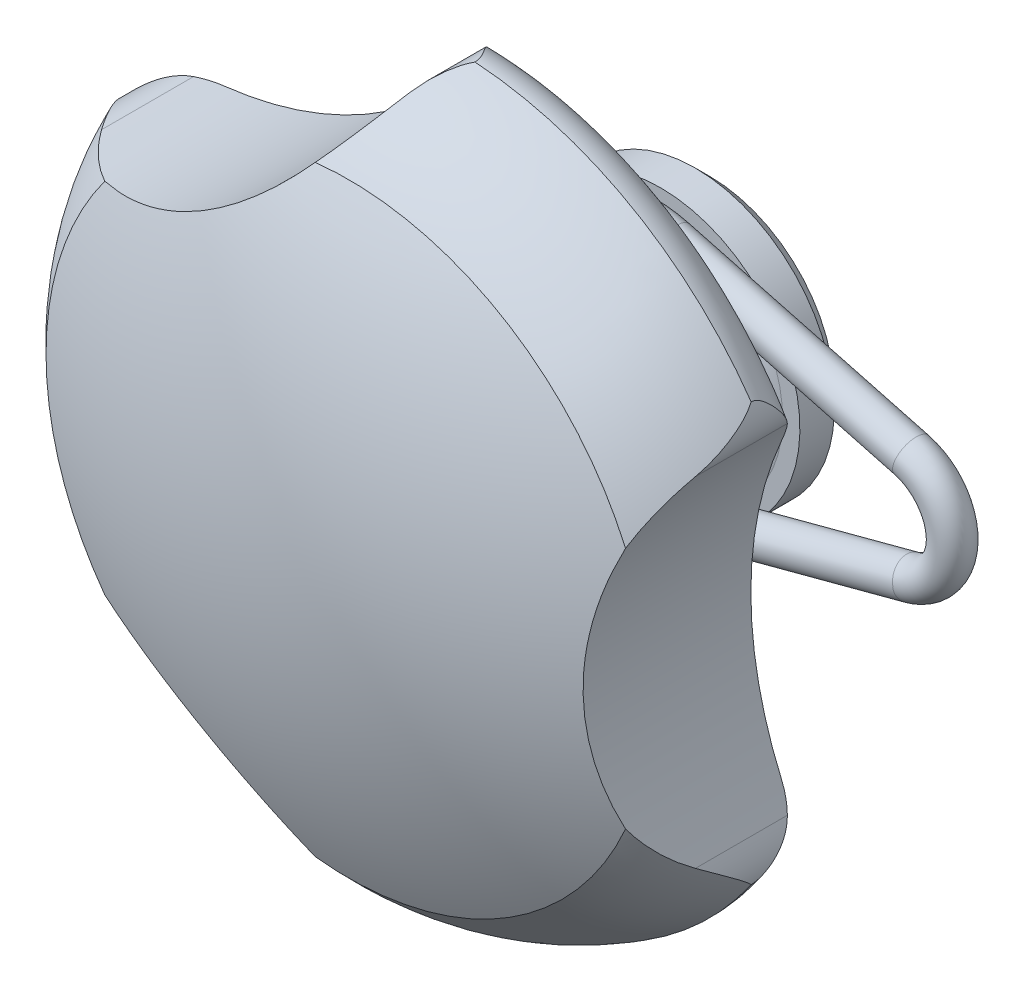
ISO-10303-21;
HEADER;
FILE_DESCRIPTION(('STEP AP214'),'2;1');
FILE_NAME('part.step','',(''),(''),'','','');
FILE_SCHEMA(('AUTOMOTIVE_DESIGN { 1 0 10303 214 1 1 1 1 }'));
ENDSEC;
DATA;
#1=APPLICATION_CONTEXT('core data for automotive mechanical design processes');
#2=APPLICATION_PROTOCOL_DEFINITION('international standard','automotive_design',2000,#1);
#3=PRODUCT_CONTEXT('',#1,'mechanical');
#4=PRODUCT('Part','Part','',(#3));
#5=PRODUCT_RELATED_PRODUCT_CATEGORY('part','',(#4));
#6=PRODUCT_DEFINITION_FORMATION('','',#4);
#7=PRODUCT_DEFINITION_CONTEXT('part definition',#1,'design');
#8=PRODUCT_DEFINITION('design','',#6,#7);
#9=PRODUCT_DEFINITION_SHAPE('','',#8);
#10=(LENGTH_UNIT() NAMED_UNIT(*) SI_UNIT(.MILLI.,.METRE.));
#11=(NAMED_UNIT(*) PLANE_ANGLE_UNIT() SI_UNIT($,.RADIAN.));
#12=(NAMED_UNIT(*) SI_UNIT($,.STERADIAN.) SOLID_ANGLE_UNIT());
#13=UNCERTAINTY_MEASURE_WITH_UNIT(LENGTH_MEASURE(1.E-05),#10,'distance_accuracy_value','');
#14=(GEOMETRIC_REPRESENTATION_CONTEXT(3) GLOBAL_UNCERTAINTY_ASSIGNED_CONTEXT((#13)) GLOBAL_UNIT_ASSIGNED_CONTEXT((#10,
#11,#12)) REPRESENTATION_CONTEXT('',''));
#15=CARTESIAN_POINT('',(0.,0.,0.));
#16=DIRECTION('',(0.,0.,1.));
#17=DIRECTION('',(1.,0.,0.));
#18=AXIS2_PLACEMENT_3D('',#15,#16,#17);
#19=CARTESIAN_POINT('',(0.,0.,5.));
#20=DIRECTION('',(0.,0.,1.));
#21=DIRECTION('',(0.,1.,0.));
#22=AXIS2_PLACEMENT_3D('',#19,#20,#21);
#23=TOROIDAL_SURFACE('',#22,8.51303191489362,1.36303191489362);
#24=CARTESIAN_POINT('',(0.,0.,6.35));
#25=DIRECTION('',(0.,0.,1.));
#26=DIRECTION('',(0.,1.,0.));
#27=AXIS2_PLACEMENT_3D('',#24,#25,#26);
#28=CIRCLE('',#27,8.325);
#29=CARTESIAN_POINT('',(0.,8.325,6.35));
#30=VERTEX_POINT('',#29);
#31=EDGE_CURVE('E869',#30,#30,#28,.T.);
#32=ORIENTED_EDGE('',*,*,#31,.F.);
#33=EDGE_LOOP('',(#32));
#34=FACE_BOUND('',#33,.T.);
#35=CARTESIAN_POINT('',(0.,0.,3.82626201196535));
#36=DIRECTION('',(0.,0.,-1.));
#37=DIRECTION('',(0.,-1.,0.));
#38=AXIS2_PLACEMENT_3D('',#35,#36,#37);
#39=CIRCLE('',#38,7.82007077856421);
#40=CARTESIAN_POINT('',(2.01086259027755,-7.55711179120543,3.82626201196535));
#41=VERTEX_POINT('',#40);
#42=CARTESIAN_POINT('',(2.01086259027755,7.55711179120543,3.82626201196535));
#43=VERTEX_POINT('',#42);
#44=EDGE_CURVE('E408',#41,#43,#39,.T.);
#45=ORIENTED_EDGE('',*,*,#44,.T.);
#46=CARTESIAN_POINT('',(1.79978858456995,7.6050382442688,6.17079126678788));
#47=CARTESIAN_POINT('',(1.87132667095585,7.59149186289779,6.17272963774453));
#48=CARTESIAN_POINT('',(1.94241225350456,7.57534963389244,6.17373412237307));
#49=CARTESIAN_POINT('',(2.08361370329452,7.53772800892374,6.17374137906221));
#50=CARTESIAN_POINT('',(2.1537211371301,7.51621701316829,6.17273204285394));
#51=CARTESIAN_POINT('',(2.29422836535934,7.4671052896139,6.16848446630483));
#52=CARTESIAN_POINT('',(2.36456641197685,7.43933249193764,6.16517628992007));
#53=CARTESIAN_POINT('',(2.50203009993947,7.37744319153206,6.15538425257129));
#54=CARTESIAN_POINT('',(2.56916408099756,7.34334443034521,6.14890919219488));
#55=CARTESIAN_POINT('',(2.6808382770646,7.27785870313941,6.13334871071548));
#56=CARTESIAN_POINT('',(2.72656691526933,7.24824577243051,6.12544804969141));
#57=CARTESIAN_POINT('',(2.81377071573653,7.18469949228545,6.10574552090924));
#58=CARTESIAN_POINT('',(2.85526523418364,7.15078755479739,6.09396255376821));
#59=CARTESIAN_POINT('',(2.932969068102,7.07800456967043,6.06455276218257));
#60=CARTESIAN_POINT('',(2.96907074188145,7.03905576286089,6.04682531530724));
#61=CARTESIAN_POINT('',(3.03278716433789,6.95844438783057,6.00390847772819));
#62=CARTESIAN_POINT('',(3.06042032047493,6.91678794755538,5.97873550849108));
#63=CARTESIAN_POINT('',(3.10308029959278,6.84040764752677,5.92493884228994));
#64=CARTESIAN_POINT('',(3.11938941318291,6.80559878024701,5.89743341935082));
#65=CARTESIAN_POINT('',(3.14643483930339,6.73833900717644,5.83719961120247));
#66=CARTESIAN_POINT('',(3.15715911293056,6.70589332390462,5.80446014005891));
#67=CARTESIAN_POINT('',(3.17635082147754,6.63794440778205,5.72671690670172));
#68=CARTESIAN_POINT('',(3.18376051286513,6.60340727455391,5.68061359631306));
#69=CARTESIAN_POINT('',(3.19472931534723,6.541536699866,5.58342505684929));
#70=CARTESIAN_POINT('',(3.19828598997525,6.51420782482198,5.5323366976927));
#71=CARTESIAN_POINT('',(3.20334911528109,6.46712692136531,5.4259287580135));
#72=CARTESIAN_POINT('',(3.20482917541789,6.44747467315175,5.37056398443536));
#73=CARTESIAN_POINT('',(3.2067932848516,6.41659026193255,5.25753712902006));
#74=CARTESIAN_POINT('',(3.20727736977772,6.40535779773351,5.19987512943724));
#75=CARTESIAN_POINT('',(3.20787839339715,6.39062655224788,5.07642770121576));
#76=CARTESIAN_POINT('',(3.20794350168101,6.38823486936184,5.01050742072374));
#77=CARTESIAN_POINT('',(3.20772512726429,6.39429674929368,4.87913366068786));
#78=CARTESIAN_POINT('',(3.20744143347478,6.40275687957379,4.81368048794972));
#79=CARTESIAN_POINT('',(3.20596728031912,6.43067595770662,4.68370261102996));
#80=CARTESIAN_POINT('',(3.20475766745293,6.4503649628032,4.61922724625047));
#81=CARTESIAN_POINT('',(3.19997017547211,6.5005030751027,4.49468200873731));
#82=CARTESIAN_POINT('',(3.1963937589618,6.53094553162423,4.43460944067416));
#83=CARTESIAN_POINT('',(3.1855950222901,6.59382025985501,4.33355651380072));
#84=CARTESIAN_POINT('',(3.17934712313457,6.62434364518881,4.29128229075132));
#85=CARTESIAN_POINT('',(3.16202710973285,6.69034974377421,4.21192295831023));
#86=CARTESIAN_POINT('',(3.15096204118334,6.72582516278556,4.17483037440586));
#87=CARTESIAN_POINT('',(3.12189383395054,6.80035573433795,4.10661172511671));
#88=CARTESIAN_POINT('',(3.10382392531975,6.83944249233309,4.07554753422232));
#89=CARTESIAN_POINT('',(3.05952168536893,6.91800331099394,4.02061890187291));
#90=CARTESIAN_POINT('',(3.03329881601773,6.95747687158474,3.99674617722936));
#91=CARTESIAN_POINT('',(2.97778974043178,7.02827703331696,3.958802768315));
#92=CARTESIAN_POINT('',(2.94954410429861,7.05994052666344,3.94380109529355));
#93=CARTESIAN_POINT('',(2.88866506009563,7.12058153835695,3.91778989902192));
#94=CARTESIAN_POINT('',(2.85602673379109,7.14955598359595,3.90678490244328));
#95=CARTESIAN_POINT('',(2.79129515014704,7.20149400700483,3.88887585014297));
#96=CARTESIAN_POINT('',(2.75953187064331,7.2247684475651,3.88165512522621));
#97=CARTESIAN_POINT('',(2.69409327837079,7.26903732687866,3.86906650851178));
#98=CARTESIAN_POINT('',(2.66041648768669,7.29002996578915,3.86370007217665));
#99=CARTESIAN_POINT('',(2.55689845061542,7.3500650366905,3.84963819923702));
#100=CARTESIAN_POINT('',(2.48490792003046,7.38590549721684,3.84306022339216));
#101=CARTESIAN_POINT('',(2.36197329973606,7.43977381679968,3.83495861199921));
#102=CARTESIAN_POINT('',(2.31190717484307,7.45978043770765,3.83248383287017));
#103=CARTESIAN_POINT('',(2.21061999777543,7.49685035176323,3.8287882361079));
#104=CARTESIAN_POINT('',(2.15939851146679,7.51391251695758,3.82756789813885));
#105=CARTESIAN_POINT('',(2.05711827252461,7.5448978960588,3.82622671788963));
#106=CARTESIAN_POINT('',(2.00607653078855,7.55887677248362,3.82608449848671));
#107=CARTESIAN_POINT('',(1.90337083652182,7.58405145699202,3.8268544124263));
#108=CARTESIAN_POINT('',(1.85170752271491,7.59524990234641,3.82776554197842));
#109=CARTESIAN_POINT('',(1.7997885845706,7.60503824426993,3.82920873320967));
#110=B_SPLINE_CURVE_WITH_KNOTS('',3,(#46,#47,#48,#49,#50,#51,#52,#53,#54,#55,#56,#57,#58,#59,
#60,#61,#62,#63,#64,#65,#66,#67,#68,#69,#70,#71,#72,#73,#74,#75,#76,#77,#78,#79,#80,#81,#82,#83,
#84,#85,#86,#87,#88,#89,#90,#91,#92,#93,#94,#95,#96,#97,#98,#99,#100,#101,#102,#103,#104,#105,
#106,#107,#108,#109),.UNSPECIFIED.,.F.,.F.,(4,2,2,2,2,2,2,2,2,2,2,2,2,2,2,2,2,2,2,2,2,2,2,2,2,2,
2,2,2,2,2,4),(0.,0.218470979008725,0.438259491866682,0.665045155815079,0.89120414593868,
1.05600690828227,1.22001891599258,1.38696047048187,1.55353653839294,1.69461095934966,
1.83598824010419,2.00931569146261,2.18275268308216,2.35837441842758,2.53398987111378,
2.73097011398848,2.92806962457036,3.12936032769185,3.33052675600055,3.48746649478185,
3.64417745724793,3.80242044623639,3.960480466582,4.09496109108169,4.22959355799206,
4.34951804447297,4.46953644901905,4.71086046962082,4.87269806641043,5.03459752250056,
5.19327819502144,5.35180777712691),.UNSPECIFIED.);
#111=CARTESIAN_POINT('',(2.01086259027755,7.55711179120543,6.17373798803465));
#112=VERTEX_POINT('',#111);
#113=EDGE_CURVE('E228',#112,#43,#110,.T.);
#114=ORIENTED_EDGE('',*,*,#113,.F.);
#115=CARTESIAN_POINT('',(0.,0.,6.17373798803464));
#116=DIRECTION('',(0.,0.,1.));
#117=DIRECTION('',(0.,1.,0.));
#118=AXIS2_PLACEMENT_3D('',#115,#116,#117);
#119=CIRCLE('',#118,7.82007077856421);
#120=CARTESIAN_POINT('',(2.01086259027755,-7.55711179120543,6.17373798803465));
#121=VERTEX_POINT('',#120);
#122=EDGE_CURVE('E25',#112,#121,#119,.T.);
#123=ORIENTED_EDGE('',*,*,#122,.T.);
#124=CARTESIAN_POINT('',(1.79978858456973,-7.60503824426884,3.82920873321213));
#125=CARTESIAN_POINT('',(1.87132667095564,-7.59149186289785,3.82727036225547));
#126=CARTESIAN_POINT('',(1.94241225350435,-7.57534963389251,3.82626587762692));
#127=CARTESIAN_POINT('',(2.08361370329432,-7.53772800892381,3.82625862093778));
#128=CARTESIAN_POINT('',(2.15372113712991,-7.51621701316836,3.82726795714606));
#129=CARTESIAN_POINT('',(2.29422836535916,-7.46710528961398,3.83151553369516));
#130=CARTESIAN_POINT('',(2.36456641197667,-7.43933249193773,3.83482371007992));
#131=CARTESIAN_POINT('',(2.5020300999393,-7.37744319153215,3.84461574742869));
#132=CARTESIAN_POINT('',(2.5691640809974,-7.3433444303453,3.8510908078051));
#133=CARTESIAN_POINT('',(2.68083827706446,-7.2778587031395,3.86665128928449));
#134=CARTESIAN_POINT('',(2.7265669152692,-7.24824577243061,3.87455195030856));
#135=CARTESIAN_POINT('',(2.81377071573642,-7.18469949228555,3.89425447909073));
#136=CARTESIAN_POINT('',(2.85526523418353,-7.15078755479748,3.90603744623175));
#137=CARTESIAN_POINT('',(2.93296906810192,-7.07800456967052,3.93544723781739));
#138=CARTESIAN_POINT('',(2.96907074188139,-7.03905576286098,3.95317468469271));
#139=CARTESIAN_POINT('',(3.03278716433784,-6.95844438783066,3.99609152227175));
#140=CARTESIAN_POINT('',(3.06042032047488,-6.91678794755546,4.02126449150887));
#141=CARTESIAN_POINT('',(3.10308029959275,-6.84040764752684,4.07506115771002));
#142=CARTESIAN_POINT('',(3.1193894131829,-6.80559878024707,4.10256658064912));
#143=CARTESIAN_POINT('',(3.14643483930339,-6.73833900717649,4.16280038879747));
#144=CARTESIAN_POINT('',(3.15715911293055,-6.70589332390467,4.19553985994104));
#145=CARTESIAN_POINT('',(3.17635082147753,-6.63794440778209,4.27328309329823));
#146=CARTESIAN_POINT('',(3.18376051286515,-6.60340727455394,4.31938640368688));
#147=CARTESIAN_POINT('',(3.19472931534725,-6.54153669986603,4.41657494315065));
#148=CARTESIAN_POINT('',(3.19828598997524,-6.51420782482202,4.46766330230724));
#149=CARTESIAN_POINT('',(3.20334911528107,-6.46712692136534,4.57407124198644));
#150=CARTESIAN_POINT('',(3.2048291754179,-6.44747467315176,4.62943601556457));
#151=CARTESIAN_POINT('',(3.20679328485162,-6.41659026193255,4.74246287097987));
#152=CARTESIAN_POINT('',(3.20727736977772,-6.40535779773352,4.80012487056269));
#153=CARTESIAN_POINT('',(3.20787839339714,-6.39062655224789,4.92357229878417));
#154=CARTESIAN_POINT('',(3.20794350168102,-6.38823486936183,4.98949257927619));
#155=CARTESIAN_POINT('',(3.20772512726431,-6.39429674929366,5.12086633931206));
#156=CARTESIAN_POINT('',(3.20744143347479,-6.40275687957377,5.1863195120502));
#157=CARTESIAN_POINT('',(3.20596728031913,-6.43067595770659,5.31629738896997));
#158=CARTESIAN_POINT('',(3.20475766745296,-6.45036496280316,5.38077275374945));
#159=CARTESIAN_POINT('',(3.19997017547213,-6.50050307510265,5.50531799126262));
#160=CARTESIAN_POINT('',(3.19639375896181,-6.53094553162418,5.56539055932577));
#161=CARTESIAN_POINT('',(3.18559502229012,-6.59382025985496,5.66644348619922));
#162=CARTESIAN_POINT('',(3.1793471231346,-6.62434364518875,5.70871770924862));
#163=CARTESIAN_POINT('',(3.16202710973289,-6.69034974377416,5.78807704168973));
#164=CARTESIAN_POINT('',(3.15096204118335,-6.72582516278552,5.82516962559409));
#165=CARTESIAN_POINT('',(3.12189383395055,-6.80035573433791,5.89338827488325));
#166=CARTESIAN_POINT('',(3.10382392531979,-6.83944249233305,5.92445246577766));
#167=CARTESIAN_POINT('',(3.05952168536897,-6.9180033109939,5.97938109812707));
#168=CARTESIAN_POINT('',(3.03329881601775,-6.9574768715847,6.00325382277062));
#169=CARTESIAN_POINT('',(2.9777897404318,-7.02827703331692,6.04119723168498));
#170=CARTESIAN_POINT('',(2.94954410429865,-7.05994052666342,6.05619890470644));
#171=CARTESIAN_POINT('',(2.88866506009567,-7.12058153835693,6.08221010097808));
#172=CARTESIAN_POINT('',(2.85602673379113,-7.14955598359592,6.09321509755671));
#173=CARTESIAN_POINT('',(2.79129515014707,-7.2014940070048,6.11112414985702));
#174=CARTESIAN_POINT('',(2.75953187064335,-7.22476844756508,6.11834487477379));
#175=CARTESIAN_POINT('',(2.69409327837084,-7.26903732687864,6.13093349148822));
#176=CARTESIAN_POINT('',(2.66041648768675,-7.29002996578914,6.13629992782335));
#177=CARTESIAN_POINT('',(2.55689845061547,-7.35006503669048,6.15036180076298));
#178=CARTESIAN_POINT('',(2.48490792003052,-7.38590549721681,6.15693977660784));
#179=CARTESIAN_POINT('',(2.3619732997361,-7.43977381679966,6.16504138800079));
#180=CARTESIAN_POINT('',(2.31190717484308,-7.45978043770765,6.16751616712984));
#181=CARTESIAN_POINT('',(2.2106199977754,-7.49685035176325,6.17121176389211));
#182=CARTESIAN_POINT('',(2.15939851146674,-7.51391251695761,6.17243210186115));
#183=CARTESIAN_POINT('',(2.05711827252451,-7.54489789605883,6.17377328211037));
#184=CARTESIAN_POINT('',(2.00607653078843,-7.55887677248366,6.17391550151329));
#185=CARTESIAN_POINT('',(1.90337083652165,-7.58405145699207,6.1731455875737));
#186=CARTESIAN_POINT('',(1.85170752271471,-7.59524990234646,6.17223445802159));
#187=CARTESIAN_POINT('',(1.79978858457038,-7.60503824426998,6.17079126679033));
#188=B_SPLINE_CURVE_WITH_KNOTS('',3,(#124,#125,#126,#127,#128,#129,#130,#131,#132,#133,#134,
#135,#136,#137,#138,#139,#140,#141,#142,#143,#144,#145,#146,#147,#148,#149,#150,#151,#152,#153,
#154,#155,#156,#157,#158,#159,#160,#161,#162,#163,#164,#165,#166,#167,#168,#169,#170,#171,#172,
#173,#174,#175,#176,#177,#178,#179,#180,#181,#182,#183,#184,#185,#186,#187),.UNSPECIFIED.,.F.,
.F.,(4,2,2,2,2,2,2,2,2,2,2,2,2,2,2,2,2,2,2,2,2,2,2,2,2,2,2,2,2,2,2,4),(0.,0.21847097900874,
0.438259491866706,0.665045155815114,0.89120414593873,1.05600690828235,1.22001891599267,
1.38696047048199,1.55353653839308,1.69461095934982,1.83598824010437,2.00931569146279,
2.18275268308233,2.35837441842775,2.53398987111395,2.73097011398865,2.92806962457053,
3.12936032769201,3.33052675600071,3.48746649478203,3.64417745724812,3.80242044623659,
3.96048046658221,4.0949610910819,4.22959355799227,4.34951804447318,4.46953644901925,
4.71086046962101,4.8726980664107,5.0345975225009,5.19327819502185,5.35180777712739),.UNSPECIFIED.);
#189=EDGE_CURVE('E200',#41,#121,#188,.T.);
#190=ORIENTED_EDGE('',*,*,#189,.F.);
#191=EDGE_LOOP('',(#45,#114,#123,#190));
#192=FACE_BOUND('',#191,.T.);
#193=CARTESIAN_POINT('',(0.,0.,3.65));
#194=DIRECTION('',(0.,0.,1.));
#195=DIRECTION('',(0.,1.,0.));
#196=AXIS2_PLACEMENT_3D('',#193,#194,#195);
#197=CIRCLE('',#196,8.325);
#198=CARTESIAN_POINT('',(0.,8.325,3.65));
#199=VERTEX_POINT('',#198);
#200=EDGE_CURVE('E866',#199,#199,#197,.T.);
#201=ORIENTED_EDGE('',*,*,#200,.T.);
#202=EDGE_LOOP('',(#201));
#203=FACE_BOUND('',#202,.T.);
#204=ADVANCED_FACE('F14',(#34,#192,#203),#23,.F.);
#205=CARTESIAN_POINT('',(0.,0.,18.));
#206=DIRECTION('',(0.,0.,1.));
#207=DIRECTION('',(0.,1.,0.));
#208=AXIS2_PLACEMENT_3D('',#205,#206,#207);
#209=TOROIDAL_SURFACE('',#208,22.,3.);
#210=CARTESIAN_POINT('',(0.,0.,15.));
#211=DIRECTION('',(0.,0.,1.));
#212=DIRECTION('',(0.,1.,0.));
#213=AXIS2_PLACEMENT_3D('',#210,#211,#212);
#214=CIRCLE('',#213,22.);
#215=CARTESIAN_POINT('',(19.5911764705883,10.009285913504,15.));
#216=VERTEX_POINT('',#215);
#217=CARTESIAN_POINT('',(-1.12729236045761,21.9710994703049,14.9999999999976));
#218=VERTEX_POINT('',#217);
#219=EDGE_CURVE('E566',#216,#218,#214,.T.);
#220=ORIENTED_EDGE('',*,*,#219,.T.);
#221=CARTESIAN_POINT('',(-4.18910416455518,18.5324420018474,18.0002));
#222=CARTESIAN_POINT('',(-4.18912689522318,18.5324223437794,17.9531521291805));
#223=CARTESIAN_POINT('',(-4.18751024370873,18.5339301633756,17.9061178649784));
#224=CARTESIAN_POINT('',(-4.18113949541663,18.5398804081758,17.812510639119));
#225=CARTESIAN_POINT('',(-4.17638961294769,18.5443188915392,17.7659371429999));
#226=CARTESIAN_POINT('',(-4.16397265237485,18.5559362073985,17.6741457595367));
#227=CARTESIAN_POINT('',(-4.15634351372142,18.5630794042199,17.6289181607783));
#228=CARTESIAN_POINT('',(-4.13839726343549,18.5799115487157,17.5394782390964));
#229=CARTESIAN_POINT('',(-4.12807910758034,18.5896014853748,17.4952663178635));
#230=CARTESIAN_POINT('',(-4.08670645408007,18.6285377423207,17.3389002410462));
#231=CARTESIAN_POINT('',(-4.04871217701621,18.664432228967,17.2301628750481));
#232=CARTESIAN_POINT('',(-3.96100131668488,18.748001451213,17.0219477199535));
#233=CARTESIAN_POINT('',(-3.91121549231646,18.7957458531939,16.92252966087));
#234=CARTESIAN_POINT('',(-3.81275965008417,18.8910986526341,16.7489826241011));
#235=CARTESIAN_POINT('',(-3.76530518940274,18.9373845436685,16.6734099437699));
#236=CARTESIAN_POINT('',(-3.66634035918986,19.0347619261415,16.5282061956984));
#237=CARTESIAN_POINT('',(-3.61482727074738,19.0858566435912,16.4585791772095));
#238=CARTESIAN_POINT('',(-3.50877674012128,19.1920330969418,16.32476704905));
#239=CARTESIAN_POINT('',(-3.45423618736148,19.2471189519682,16.2605877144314));
#240=CARTESIAN_POINT('',(-3.34291527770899,19.3606605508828,16.1373400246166));
#241=CARTESIAN_POINT('',(-3.2861342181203,19.4191173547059,16.0782732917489));
#242=CARTESIAN_POINT('',(-3.13582303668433,19.5754544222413,15.9304681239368));
#243=CARTESIAN_POINT('',(-3.04095737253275,19.6756771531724,15.8455475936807));
#244=CARTESIAN_POINT('',(-2.84848861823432,19.8825934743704,15.6874401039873));
#245=CARTESIAN_POINT('',(-2.75088405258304,19.9892905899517,15.6142596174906));
#246=CARTESIAN_POINT('',(-2.55396483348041,20.2084895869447,15.4794179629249));
#247=CARTESIAN_POINT('',(-2.45464845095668,20.3209975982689,15.4177692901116));
#248=CARTESIAN_POINT('',(-2.25530271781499,20.5510913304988,15.3063317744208));
#249=CARTESIAN_POINT('',(-2.15527352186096,20.668675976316,15.2565404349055));
#250=CARTESIAN_POINT('',(-1.95335182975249,20.9106507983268,15.168540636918));
#251=CARTESIAN_POINT('',(-1.8514596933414,21.0351274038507,15.1305677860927));
#252=CARTESIAN_POINT('',(-1.64845848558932,21.288158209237,15.0683792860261));
#253=CARTESIAN_POINT('',(-1.54734957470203,21.4167132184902,15.0441663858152));
#254=CARTESIAN_POINT('',(-1.34695254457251,21.6767846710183,15.0106804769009));
#255=CARTESIAN_POINT('',(-1.24766115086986,21.8082945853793,15.0013772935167));
#256=CARTESIAN_POINT('',(-1.05169678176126,22.0732680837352,14.9989053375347));
#257=CARTESIAN_POINT('',(-0.955022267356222,22.2067304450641,15.0057268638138));
#258=CARTESIAN_POINT('',(-0.734867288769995,22.5170661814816,15.0419097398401));
#259=CARTESIAN_POINT('',(-0.612671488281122,22.694208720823,15.0777661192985));
#260=CARTESIAN_POINT('',(-0.436454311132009,22.9566210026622,15.1565532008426));
#261=CARTESIAN_POINT('',(-0.378947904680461,23.0434575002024,15.1869404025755));
#262=CARTESIAN_POINT('',(-0.26659256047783,23.2153799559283,15.2563262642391));
#263=CARTESIAN_POINT('',(-0.211742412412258,23.3004667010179,15.2953209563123));
#264=CARTESIAN_POINT('',(-0.111337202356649,23.4582473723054,15.3770660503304));
#265=CARTESIAN_POINT('',(-0.0654443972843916,23.5312287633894,15.4188471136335));
#266=CARTESIAN_POINT('',(0.0236907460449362,23.6745427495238,15.5093769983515));
#267=CARTESIAN_POINT('',(0.0669307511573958,23.7448729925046,15.558131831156));
#268=CARTESIAN_POINT('',(0.108677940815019,23.8135096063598,15.6103800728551));
#269=B_SPLINE_CURVE_WITH_KNOTS('',3,(#221,#222,#223,#224,#225,#226,#227,#228,#229,#230,#231,
#232,#233,#234,#235,#236,#237,#238,#239,#240,#241,#242,#243,#244,#245,#246,#247,#248,#249,#250,
#251,#252,#253,#254,#255,#256,#257,#258,#259,#260,#261,#262,#263,#264,#265,#266,#267,#268),
.UNSPECIFIED.,.F.,.F.,(4,2,2,2,2,2,2,2,2,2,2,2,2,2,2,2,2,2,2,2,2,2,2,4),(0.,0.141068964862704,
0.28194857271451,0.421033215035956,0.560171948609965,0.919912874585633,1.28182102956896,
1.58297830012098,1.88433906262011,2.18601540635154,2.48778712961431,2.97320384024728,
3.45888727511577,3.94509396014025,4.43119818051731,4.92645023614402,5.42180120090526,
5.91614838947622,6.41019823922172,7.061822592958,7.38699409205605,7.71201600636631,
7.99910829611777,8.28644956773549),.UNSPECIFIED.);
#270=CARTESIAN_POINT('',(0.108556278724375,23.8133096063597,15.6102278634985));
#271=VERTEX_POINT('',#270);
#272=EDGE_CURVE('E325',#218,#271,#269,.T.);
#273=ORIENTED_EDGE('',*,*,#272,.T.);
#274=CARTESIAN_POINT('',(1.66020053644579,24.9448137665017,18.0002));
#275=CARTESIAN_POINT('',(1.66026271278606,24.9448191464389,17.964656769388));
#276=CARTESIAN_POINT('',(1.65815320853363,24.9443218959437,17.9291682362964));
#277=CARTESIAN_POINT('',(1.65005918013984,24.9423600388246,17.8588144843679));
#278=CARTESIAN_POINT('',(1.64409182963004,24.940899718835,17.823947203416));
#279=CARTESIAN_POINT('',(1.62141224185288,24.9352099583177,17.7221134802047));
#280=CARTESIAN_POINT('',(1.59988115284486,24.9296678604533,17.6562996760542));
#281=CARTESIAN_POINT('',(1.55273506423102,24.9165473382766,17.5390744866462));
#282=CARTESIAN_POINT('',(1.52836170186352,24.9094494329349,17.4870665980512));
#283=CARTESIAN_POINT('',(1.47581939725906,24.8931142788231,17.3853310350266));
#284=CARTESIAN_POINT('',(1.44764777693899,24.8838755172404,17.3356050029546));
#285=CARTESIAN_POINT('',(1.35873418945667,24.852731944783,17.1878379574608));
#286=CARTESIAN_POINT('',(1.29430369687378,24.8275754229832,17.0927266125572));
#287=CARTESIAN_POINT('',(1.16216346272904,24.7688074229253,16.9081919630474));
#288=CARTESIAN_POINT('',(1.09446514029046,24.7352238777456,16.8187510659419));
#289=CARTESIAN_POINT('',(0.958372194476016,24.6593009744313,16.6440766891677));
#290=CARTESIAN_POINT('',(0.889977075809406,24.616954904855,16.5588464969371));
#291=CARTESIAN_POINT('',(0.755009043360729,24.5236019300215,16.3930512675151));
#292=CARTESIAN_POINT('',(0.688426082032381,24.4726651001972,16.3124550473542));
#293=CARTESIAN_POINT('',(0.558093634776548,24.3616402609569,16.1554852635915));
#294=CARTESIAN_POINT('',(0.494341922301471,24.3015596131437,16.0791083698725));
#295=CARTESIAN_POINT('',(0.373994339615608,24.1749962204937,15.9345666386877));
#296=CARTESIAN_POINT('',(0.317202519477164,24.1089518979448,15.8661841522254));
#297=CARTESIAN_POINT('',(0.208623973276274,23.9678265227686,15.7342222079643));
#298=CARTESIAN_POINT('',(0.156859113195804,23.8927089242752,15.6706639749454));
#299=CARTESIAN_POINT('',(0.108434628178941,23.8131096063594,15.6100756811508));
#300=B_SPLINE_CURVE_WITH_KNOTS('',3,(#274,#275,#276,#277,#278,#279,#280,#281,#282,#283,#284,
#285,#286,#287,#288,#289,#290,#291,#292,#293,#294,#295,#296,#297,#298,#299),.UNSPECIFIED.,.F.,
.F.,(4,2,2,2,2,2,2,2,2,2,2,2,4),(0.,0.106471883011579,0.212473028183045,0.419728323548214,
0.59312825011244,0.766651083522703,1.11870906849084,1.46961515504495,1.82079101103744,
2.16922978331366,2.51738950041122,2.84904713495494,3.18208821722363),.UNSPECIFIED.);
#301=CARTESIAN_POINT('',(1.66020055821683,24.9448137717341,18.));
#302=VERTEX_POINT('',#301);
#303=EDGE_CURVE('E364',#302,#271,#300,.T.);
#304=ORIENTED_EDGE('',*,*,#303,.F.);
#305=CARTESIAN_POINT('',(0.,0.,18.));
#306=DIRECTION('',(0.,0.,1.));
#307=DIRECTION('',(0.,1.,0.));
#308=AXIS2_PLACEMENT_3D('',#305,#306,#307);
#309=CIRCLE('',#308,25.);
#310=CARTESIAN_POINT('',(20.5226011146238,14.2766537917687,18.0000000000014));
#311=VERTEX_POINT('',#310);
#312=EDGE_CURVE('E539',#311,#302,#309,.T.);
#313=ORIENTED_EDGE('',*,*,#312,.F.);
#314=CARTESIAN_POINT('',(20.3463625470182,11.5851779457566,15.3538541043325));
#315=CARTESIAN_POINT('',(20.3913177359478,11.671126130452,15.3974520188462));
#316=CARTESIAN_POINT('',(20.4318446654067,11.7577410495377,15.4440874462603));
#317=CARTESIAN_POINT('',(20.5044144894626,11.9313674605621,15.5425676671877));
#318=CARTESIAN_POINT('',(20.5364710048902,12.0183780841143,15.5944039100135));
#319=CARTESIAN_POINT('',(20.5925223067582,12.1918549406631,15.7023874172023));
#320=CARTESIAN_POINT('',(20.616543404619,12.2783220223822,15.7585198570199));
#321=CARTESIAN_POINT('',(20.6571629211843,12.4504114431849,15.8746919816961));
#322=CARTESIAN_POINT('',(20.6737577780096,12.536033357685,15.9347335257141));
#323=CARTESIAN_POINT('',(20.703048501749,12.7255462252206,16.0726045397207));
#324=CARTESIAN_POINT('',(20.7139457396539,12.8290654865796,16.1513283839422));
#325=CARTESIAN_POINT('',(20.7261437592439,13.0329273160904,16.3135287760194));
#326=CARTESIAN_POINT('',(20.7274408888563,13.1332686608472,16.397007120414));
#327=CARTESIAN_POINT('',(20.7214706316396,13.3295694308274,16.5686172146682));
#328=CARTESIAN_POINT('',(20.7142049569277,13.4255297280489,16.6567480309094));
#329=CARTESIAN_POINT('',(20.692377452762,13.6114497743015,16.8381845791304));
#330=CARTESIAN_POINT('',(20.6778219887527,13.7014146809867,16.9314857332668));
#331=CARTESIAN_POINT('',(20.6491188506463,13.8442758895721,17.0933853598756));
#332=CARTESIAN_POINT('',(20.6364027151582,13.8996534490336,17.1600511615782));
#333=CARTESIAN_POINT('',(20.6097142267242,14.0045009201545,17.2978180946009));
#334=CARTESIAN_POINT('',(20.5957415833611,14.0539694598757,17.3689202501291));
#335=CARTESIAN_POINT('',(20.5729520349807,14.129046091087,17.4939982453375));
#336=CARTESIAN_POINT('',(20.5638947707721,14.1572671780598,17.546334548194));
#337=CARTESIAN_POINT('',(20.5474921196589,14.2065844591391,17.6543049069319));
#338=CARTESIAN_POINT('',(20.5401364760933,14.2277237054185,17.7099165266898));
#339=CARTESIAN_POINT('',(20.5307638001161,14.2541808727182,17.8047610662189));
#340=CARTESIAN_POINT('',(20.5277808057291,14.2624394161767,17.84305386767));
#341=CARTESIAN_POINT('',(20.5236625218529,14.2737584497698,17.9209139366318));
#342=CARTESIAN_POINT('',(20.5225481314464,14.2767601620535,17.9604906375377));
#343=CARTESIAN_POINT('',(20.5226011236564,14.276653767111,18.0002));
#344=B_SPLINE_CURVE_WITH_KNOTS('',3,(#314,#315,#316,#317,#318,#319,#320,#321,#322,#323,#324,
#325,#326,#327,#328,#329,#330,#331,#332,#333,#334,#335,#336,#337,#338,#339,#340,#341,#342,#343),
.UNSPECIFIED.,.F.,.F.,(4,2,2,2,2,2,2,2,2,2,2,2,2,2,4),(0.,0.318764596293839,0.637013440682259,
0.954209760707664,1.27155805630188,1.66255473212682,2.05370014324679,2.4447673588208,
2.83549368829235,3.09808919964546,3.3607455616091,3.54086286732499,3.71986443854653,
3.83734239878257,3.95612571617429),.UNSPECIFIED.);
#345=CARTESIAN_POINT('',(20.346467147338,11.5853779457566,15.353955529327));
#346=VERTEX_POINT('',#345);
#347=EDGE_CURVE('E356',#346,#311,#344,.T.);
#348=ORIENTED_EDGE('',*,*,#347,.F.);
#349=CARTESIAN_POINT('',(20.3465717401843,11.5855779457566,15.3540569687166));
#350=CARTESIAN_POINT('',(20.2920306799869,11.481316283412,15.3011546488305));
#351=CARTESIAN_POINT('',(20.2369860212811,11.3742416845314,15.2545689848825));
#352=CARTESIAN_POINT('',(20.126774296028,11.1558738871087,15.1736172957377));
#353=CARTESIAN_POINT('',(20.071607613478,11.0445884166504,15.139229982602));
#354=CARTESIAN_POINT('',(19.9623713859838,10.8199252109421,15.082355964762));
#355=CARTESIAN_POINT('',(19.9082963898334,10.7065781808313,15.0597572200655));
#356=CARTESIAN_POINT('',(19.8012538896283,10.4777359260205,15.0253381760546));
#357=CARTESIAN_POINT('',(19.748286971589,10.3622396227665,15.0135234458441));
#358=CARTESIAN_POINT('',(19.5761333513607,9.97905226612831,14.9913202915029));
#359=CARTESIAN_POINT('',(19.4601991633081,9.70833254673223,15.0026738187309));
#360=CARTESIAN_POINT('',(19.2950181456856,9.30325418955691,15.0544204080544));
#361=CARTESIAN_POINT('',(19.2412821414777,9.16804256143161,15.0775617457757));
#362=CARTESIAN_POINT('',(19.1369217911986,8.89872614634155,15.1347295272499));
#363=CARTESIAN_POINT('',(19.0862961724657,8.76462092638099,15.1687514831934));
#364=CARTESIAN_POINT('',(18.9874144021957,8.495835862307,15.2477642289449));
#365=CARTESIAN_POINT('',(18.9392179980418,8.36118983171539,15.2929430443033));
#366=CARTESIAN_POINT('',(18.8462716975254,8.09450877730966,15.3934790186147));
#367=CARTESIAN_POINT('',(18.8015223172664,7.96247414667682,15.4488376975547));
#368=CARTESIAN_POINT('',(18.7156186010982,7.7020747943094,15.5693993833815));
#369=CARTESIAN_POINT('',(18.6744579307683,7.57370388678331,15.6345844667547));
#370=CARTESIAN_POINT('',(18.59573689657,7.32145298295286,15.7748995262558));
#371=CARTESIAN_POINT('',(18.5581750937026,7.19757120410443,15.8500254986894));
#372=CARTESIAN_POINT('',(18.4786738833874,6.9281824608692,16.0288226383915));
#373=CARTESIAN_POINT('',(18.4376572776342,6.78409823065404,16.135110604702));
#374=CARTESIAN_POINT('',(18.3806925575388,6.57754878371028,16.307439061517));
#375=CARTESIAN_POINT('',(18.3624641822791,6.5102944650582,16.3670319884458));
#376=CARTESIAN_POINT('',(18.3276380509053,6.37977061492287,16.4908630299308));
#377=CARTESIAN_POINT('',(18.3110398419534,6.31649997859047,16.5550998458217));
#378=CARTESIAN_POINT('',(18.2727620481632,6.16839053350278,16.7177667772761));
#379=CARTESIAN_POINT('',(18.2520277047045,6.08619506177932,16.8188812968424));
#380=CARTESIAN_POINT('',(18.2150282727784,5.93683885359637,17.0324932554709));
#381=CARTESIAN_POINT('',(18.1987549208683,5.86965036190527,17.1449691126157));
#382=CARTESIAN_POINT('',(18.1756364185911,5.77296213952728,17.3480480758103));
#383=CARTESIAN_POINT('',(18.1674271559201,5.73817712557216,17.435951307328));
#384=CARTESIAN_POINT('',(18.1545118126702,5.6831351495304,17.616362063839));
#385=CARTESIAN_POINT('',(18.1497950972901,5.66283409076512,17.7088546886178));
#386=CARTESIAN_POINT('',(18.1460626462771,5.64674658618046,17.8351536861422));
#387=CARTESIAN_POINT('',(18.1453338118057,5.64360164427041,17.8680674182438));
#388=CARTESIAN_POINT('',(18.1443607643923,5.63940086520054,17.9340491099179));
#389=CARTESIAN_POINT('',(18.1441167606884,5.6383459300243,17.9671171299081));
#390=CARTESIAN_POINT('',(18.1441176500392,5.63835037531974,18.0002));
#391=B_SPLINE_CURVE_WITH_KNOTS('',3,(#349,#350,#351,#352,#353,#354,#355,#356,#357,#358,#359,
#360,#361,#362,#363,#364,#365,#366,#367,#368,#369,#370,#371,#372,#373,#374,#375,#376,#377,#378,
#379,#380,#381,#382,#383,#384,#385,#386,#387,#388,#389,#390),.UNSPECIFIED.,.F.,.F.,(4,2,2,2,2,2,
2,2,2,2,2,2,2,2,2,2,2,2,2,2,4),(0.,0.38669585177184,0.772713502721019,1.15499229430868,
1.53746839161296,2.41622089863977,2.85791414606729,3.29942544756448,3.74895692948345,
4.19855558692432,4.64734387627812,5.09595196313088,5.64571847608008,5.92060747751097,
6.19541990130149,6.59021037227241,6.98426452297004,7.26792470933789,7.55071755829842,
7.64987637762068,7.74907798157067),.UNSPECIFIED.);
#392=EDGE_CURVE('E317',#346,#216,#391,.T.);
#393=ORIENTED_EDGE('',*,*,#392,.T.);
#394=EDGE_LOOP('',(#220,#273,#304,#313,#348,#393));
#395=FACE_BOUND('',#394,.T.);
#396=ADVANCED_FACE('F221',(#395),#209,.T.);
#397=CARTESIAN_POINT('',(-0.140128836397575,-23.4130463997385,15.3538490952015));
#398=CARTESIAN_POINT('',(-0.0881734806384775,-23.4949528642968,15.3974466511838));
#399=CARTESIAN_POINT('',(-0.0334265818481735,-23.5733577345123,15.4440817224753));
#400=CARTESIAN_POINT('',(0.0806526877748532,-23.7230184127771,15.5425612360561));
#401=CARTESIAN_POINT('',(0.139977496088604,-23.7942855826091,15.5943971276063));
#402=CARTESIAN_POINT('',(0.262186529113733,-23.9295660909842,15.7023799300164));
#403=CARTESIAN_POINT('',(0.325058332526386,-23.993602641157,15.7585120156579));
#404=CARTESIAN_POINT('',(0.453781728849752,-24.1148251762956,15.8746834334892));
#405=CARTESIAN_POINT('',(0.519634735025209,-24.1720078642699,15.9347246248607));
#406=CARTESIAN_POINT('',(0.669111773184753,-24.2921313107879,16.0725949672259));
#407=CARTESIAN_POINT('',(0.75331323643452,-24.3533285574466,16.1513185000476));
#408=CARTESIAN_POINT('',(0.92376334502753,-24.4658239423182,16.3135182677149));
#409=CARTESIAN_POINT('',(1.01001275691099,-24.5171183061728,16.396996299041));
#410=CARTESIAN_POINT('',(1.18299906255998,-24.6100990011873,16.5686057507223));
#411=CARTESIAN_POINT('',(1.26973585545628,-24.6517872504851,16.6567362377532));
#412=CARTESIAN_POINT('',(1.44166100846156,-24.7258448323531,16.8381720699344));
#413=CARTESIAN_POINT('',(1.52685065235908,-24.7582222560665,16.9314728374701));
#414=CARTESIAN_POINT('',(1.66492459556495,-24.8047960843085,17.0933725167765));
#415=CARTESIAN_POINT('',(1.71924185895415,-24.8214728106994,17.1600388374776));
#416=CARTESIAN_POINT('',(1.82338839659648,-24.850784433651,17.2978068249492));
#417=CARTESIAN_POINT('',(1.8732166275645,-24.8634183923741,17.3689095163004));
#418=CARTESIAN_POINT('',(1.94963119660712,-24.8812208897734,17.4939883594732));
#419=CARTESIAN_POINT('',(1.97860062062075,-24.8874877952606,17.5463249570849));
#420=CARTESIAN_POINT('',(2.02951324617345,-24.8979416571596,17.6542959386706));
#421=CARTESIAN_POINT('',(2.05149886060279,-24.902141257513,17.7099078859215));
#422=CARTESIAN_POINT('',(2.07909916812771,-24.9072531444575,17.8047540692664));
#423=CARTESIAN_POINT('',(2.08774337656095,-24.9087991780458,17.8430481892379));
#424=CARTESIAN_POINT('',(2.09960593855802,-24.9108923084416,17.9209110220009));
#425=CARTESIAN_POINT('',(2.10276293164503,-24.9114281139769,17.9604891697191));
#426=CARTESIAN_POINT('',(2.10264428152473,-24.911420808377,18.0002));
#427=B_SPLINE_CURVE_WITH_KNOTS('',3,(#397,#398,#399,#400,#401,#402,#403,#404,#405,#406,#407,
#408,#409,#410,#411,#412,#413,#414,#415,#416,#417,#418,#419,#420,#421,#422,#423,#424,#425,#426),
.UNSPECIFIED.,.F.,.F.,(4,2,2,2,2,2,2,2,2,2,2,2,2,2,4),(0.,0.318763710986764,0.637011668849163,
0.954207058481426,1.27155442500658,1.66255056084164,2.05369542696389,2.44476212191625,
2.83548794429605,3.09808642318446,3.36074577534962,3.54086480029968,3.7198680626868,
3.8373502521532,3.95613792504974),.UNSPECIFIED.);
#428=CARTESIAN_POINT('',(-0.1400019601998,-23.4132463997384,15.3539555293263));
#429=VERTEX_POINT('',#428);
#430=CARTESIAN_POINT('',(2.10264430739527,-24.9114208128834,18.0000000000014));
#431=VERTEX_POINT('',#430);
#432=EDGE_CURVE('E382',#429,#431,#427,.T.);
#433=ORIENTED_EDGE('',*,*,#432,.F.);
#434=CARTESIAN_POINT('',(-0.139875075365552,-23.4134463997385,15.3540619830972));
#435=CARTESIAN_POINT('',(-0.2028976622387,-23.3140817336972,15.3011592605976));
#436=CARTESIAN_POINT('',(-0.268104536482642,-23.2128744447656,15.2545732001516));
#437=CARTESIAN_POINT('',(-0.402110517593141,-23.0082445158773,15.1736207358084));
#438=CARTESIAN_POINT('',(-0.470903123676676,-22.9048260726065,15.139233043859));
#439=CARTESIAN_POINT('',(-0.610848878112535,-22.6978931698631,15.0823582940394));
#440=CARTESIAN_POINT('',(-0.681972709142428,-22.5943893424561,15.0597591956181));
#441=CARTESIAN_POINT('',(-0.826634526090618,-22.3872666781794,15.0253394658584));
#442=CARTESIAN_POINT('',(-0.90017373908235,-22.2836478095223,15.0135244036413));
#443=CARTESIAN_POINT('',(-1.14594639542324,-21.9429650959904,14.9913202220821));
#444=CARTESIAN_POINT('',(-1.32242901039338,-21.707203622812,15.0026729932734));
#445=CARTESIAN_POINT('',(-1.59064602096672,-21.3616139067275,15.0544183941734));
#446=CARTESIAN_POINT('',(-1.68087451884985,-21.24747147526,15.0775593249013));
#447=CARTESIAN_POINT('',(-1.86192880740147,-21.0224347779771,15.1347262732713));
#448=CARTESIAN_POINT('',(-1.95275433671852,-20.9115391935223,15.168747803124));
#449=CARTESIAN_POINT('',(-2.13608778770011,-20.6915126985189,15.2477596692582));
#450=CARTESIAN_POINT('',(-2.22859630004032,-20.5824504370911,15.2929380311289));
#451=CARTESIAN_POINT('',(-2.41307540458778,-20.3686161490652,15.3934730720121));
#452=CARTESIAN_POINT('',(-2.5050459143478,-20.2638447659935,15.4488312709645));
#453=CARTESIAN_POINT('',(-2.68760626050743,-20.0592503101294,15.5693919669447));
#454=CARTESIAN_POINT('',(-2.77819828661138,-19.9594186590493,15.6345765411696));
#455=CARTESIAN_POINT('',(-2.95729329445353,-19.7651187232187,15.7748905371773));
#456=CARTESIAN_POINT('',(-3.04579710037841,-19.6706483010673,15.8500159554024));
#457=CARTESIAN_POINT('',(-3.23934519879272,-19.4671023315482,16.0288129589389));
#458=CARTESIAN_POINT('',(-3.34361873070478,-19.3595374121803,16.1351015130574));
#459=CARTESIAN_POINT('',(-3.49401524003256,-19.2069278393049,16.3074310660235));
#460=CARTESIAN_POINT('',(-3.54314559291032,-19.1575138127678,16.3670243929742));
#461=CARTESIAN_POINT('',(-3.63877065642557,-19.062090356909,16.4908563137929));
#462=CARTESIAN_POINT('',(-3.68526609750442,-19.0160799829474,16.5550936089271));
#463=CARTESIAN_POINT('',(-3.79439449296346,-18.9088749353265,16.7177609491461));
#464=CARTESIAN_POINT('',(-3.8552109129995,-18.8498204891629,16.8188753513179));
#465=CARTESIAN_POINT('',(-3.96605798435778,-18.7430994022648,17.03248708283));
#466=CARTESIAN_POINT('',(-4.0161085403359,-18.6954117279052,17.1449628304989));
#467=CARTESIAN_POINT('',(-4.08828433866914,-18.6270458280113,17.3480417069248));
#468=CARTESIAN_POINT('',(-4.11430468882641,-18.6025436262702,17.4359449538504));
#469=CARTESIAN_POINT('',(-4.15551533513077,-18.5638370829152,17.6163557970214));
#470=CARTESIAN_POINT('',(-4.17073850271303,-18.5496014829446,17.7088484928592));
#471=CARTESIAN_POINT('',(-4.18280494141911,-18.5383248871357,17.8351485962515));
#472=CARTESIAN_POINT('',(-4.18516426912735,-18.5361210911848,17.8680633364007));
#473=CARTESIAN_POINT('',(-4.1883159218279,-18.5331778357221,17.9340470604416));
#474=CARTESIAN_POINT('',(-4.18910757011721,-18.5324390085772,17.9671161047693));
#475=CARTESIAN_POINT('',(-4.1891041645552,-18.5324420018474,18.0002));
#476=B_SPLINE_CURVE_WITH_KNOTS('',3,(#434,#435,#436,#437,#438,#439,#440,#441,#442,#443,#444,
#445,#446,#447,#448,#449,#450,#451,#452,#453,#454,#455,#456,#457,#458,#459,#460,#461,#462,#463,
#464,#465,#466,#467,#468,#469,#470,#471,#472,#473,#474,#475),.UNSPECIFIED.,.F.,.F.,(4,2,2,2,2,2,
2,2,2,2,2,2,2,2,2,2,2,2,2,2,4),(0.,0.386695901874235,0.772713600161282,1.15499242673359,
1.53746855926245,2.41621937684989,2.85791176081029,3.29942219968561,3.74895282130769,
4.19855061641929,4.64733807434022,5.09594533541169,5.64571736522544,5.92060911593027,
6.19542428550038,6.59021513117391,6.98426966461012,7.26793032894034,7.55072365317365,
7.64988553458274,7.74909021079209),.UNSPECIFIED.);
#477=CARTESIAN_POINT('',(-1.12729236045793,-21.9710994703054,15.));
#478=VERTEX_POINT('',#477);
#479=EDGE_CURVE('E341',#429,#478,#476,.T.);
#480=ORIENTED_EDGE('',*,*,#479,.T.);
#481=CARTESIAN_POINT('',(19.5911764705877,-10.0092859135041,14.9999999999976));
#482=VERTEX_POINT('',#481);
#483=EDGE_CURVE('E560',#478,#482,#214,.T.);
#484=ORIENTED_EDGE('',*,*,#483,.T.);
#485=CARTESIAN_POINT('',(18.1441176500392,-5.63835037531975,18.0002));
#486=CARTESIAN_POINT('',(18.1441119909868,-5.6383208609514,17.9531521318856));
#487=CARTESIAN_POINT('',(18.1446094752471,-5.64047483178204,17.9061178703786));
#488=CARTESIAN_POINT('',(18.1465771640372,-5.64896718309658,17.8125106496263));
#489=CARTESIAN_POINT('',(18.1480460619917,-5.65529994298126,17.7659371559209));
#490=CARTESIAN_POINT('',(18.151898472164,-5.67186200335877,17.6741457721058));
#491=CARTESIAN_POINT('',(18.1542700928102,-5.68204062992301,17.6289181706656));
#492=CARTESIAN_POINT('',(18.1598740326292,-5.70599861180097,17.5394782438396));
#493=CARTESIAN_POINT('',(18.1631066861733,-5.7197793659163,17.4952663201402));
#494=CARTESIAN_POINT('',(18.1761400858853,-5.77507700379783,17.3389009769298));
#495=CARTESIAN_POINT('',(18.1882283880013,-5.82592785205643,17.2301642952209));
#496=CARTESIAN_POINT('',(18.2167459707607,-5.94367208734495,17.0219490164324));
#497=CARTESIAN_POINT('',(18.2332010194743,-6.01066047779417,16.9225302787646));
#498=CARTESIAN_POINT('',(18.2665518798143,-6.14360546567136,16.7489788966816));
#499=CARTESIAN_POINT('',(18.282910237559,-6.2078483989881,16.6734027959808));
#500=CARTESIAN_POINT('',(18.3177609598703,-6.3422500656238,16.5281927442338));
#501=CARTESIAN_POINT('',(18.3362547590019,-6.41241276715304,16.4585628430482));
#502=CARTESIAN_POINT('',(18.3751813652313,-6.55734431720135,16.3247517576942));
#503=CARTESIAN_POINT('',(18.3956160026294,-6.6321174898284,16.2605758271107));
#504=CARTESIAN_POINT('',(18.4382836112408,-6.78528813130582,16.1373344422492));
#505=CARTESIAN_POINT('',(18.4605171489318,-6.86368673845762,16.0782706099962));
#506=CARTESIAN_POINT('',(18.5207407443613,-7.07198470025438,15.9304965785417));
#507=CARTESIAN_POINT('',(18.5600903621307,-7.20420967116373,15.8456006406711));
#508=CARTESIAN_POINT('',(18.6430221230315,-7.47426245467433,15.6875353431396));
#509=CARTESIAN_POINT('',(18.6866065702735,-7.61209329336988,15.6143724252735));
#510=CARTESIAN_POINT('',(18.7779733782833,-7.8922235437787,15.4795166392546));
#511=CARTESIAN_POINT('',(18.825762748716,-8.03453015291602,15.4178434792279));
#512=CARTESIAN_POINT('',(18.9253854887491,-8.32230349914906,15.3063635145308));
#513=CARTESIAN_POINT('',(18.9772180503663,-8.46776960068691,15.2565543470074));
#514=CARTESIAN_POINT('',(19.0859147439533,-8.76390200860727,15.1684725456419));
#515=CARTESIAN_POINT('',(19.1428589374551,-8.9146140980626,15.130451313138));
#516=CARTESIAN_POINT('',(19.2606794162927,-9.21739522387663,15.0682110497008));
#517=CARTESIAN_POINT('',(19.3215563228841,-9.3694644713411,15.043994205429));
#518=CARTESIAN_POINT('',(19.446588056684,-9.67300193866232,15.0106038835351));
#519=CARTESIAN_POINT('',(19.5107237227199,-9.82446905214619,15.0013510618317));
#520=CARTESIAN_POINT('',(19.6420227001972,-10.1262036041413,14.9989218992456));
#521=CARTESIAN_POINT('',(19.7091860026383,-10.2764710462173,15.005745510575));
#522=CARTESIAN_POINT('',(19.8698898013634,-10.6267061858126,15.042389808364));
#523=CARTESIAN_POINT('',(19.9644073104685,-10.8255873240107,15.0794477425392));
#524=CARTESIAN_POINT('',(20.1073339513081,-11.1166731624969,15.1615573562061));
#525=CARTESIAN_POINT('',(20.1553658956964,-11.2128726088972,15.1935328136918));
#526=CARTESIAN_POINT('',(20.2512482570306,-11.4019441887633,15.2667560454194));
#527=CARTESIAN_POINT('',(20.2990983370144,-11.4948116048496,15.3080164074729));
#528=CARTESIAN_POINT('',(20.3465716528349,-11.585577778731,15.3540568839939));
#529=B_SPLINE_CURVE_WITH_KNOTS('',3,(#485,#486,#487,#488,#489,#490,#491,#492,#493,#494,#495,
#496,#497,#498,#499,#500,#501,#502,#503,#504,#505,#506,#507,#508,#509,#510,#511,#512,#513,#514,
#515,#516,#517,#518,#519,#520,#521,#522,#523,#524,#525,#526,#527,#528),.UNSPECIFIED.,.F.,.F.,(4,
2,2,2,2,2,2,2,2,2,2,2,2,2,2,2,2,2,2,2,2,4),(0.,0.141068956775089,0.281948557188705,
0.421033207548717,0.560171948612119,0.919910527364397,1.28182103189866,1.58299253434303,
1.88436755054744,2.18602965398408,2.48778712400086,2.97305233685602,3.45858307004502,
3.94493910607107,4.43119819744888,4.92720931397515,5.4232989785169,5.91674948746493,
6.41019852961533,7.07700946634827,7.41316443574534,7.74977791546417),.UNSPECIFIED.);
#530=CARTESIAN_POINT('',(20.3464670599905,-11.585377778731,15.3539554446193));
#531=VERTEX_POINT('',#530);
#532=EDGE_CURVE('E305',#482,#531,#529,.T.);
#533=ORIENTED_EDGE('',*,*,#532,.T.);
#534=CARTESIAN_POINT('',(20.5226011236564,-14.276653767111,18.0002));
#535=CARTESIAN_POINT('',(20.5224876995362,-14.2768769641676,17.9484498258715));
#536=CARTESIAN_POINT('',(20.5244101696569,-14.2717268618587,17.8971109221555));
#537=CARTESIAN_POINT('',(20.5312022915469,-14.2529596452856,17.7972366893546));
#538=CARTESIAN_POINT('',(20.5360107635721,-14.2395181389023,17.7486654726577));
#539=CARTESIAN_POINT('',(20.5509029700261,-14.1965612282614,17.6264462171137));
#540=CARTESIAN_POINT('',(20.5624270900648,-14.162242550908,17.5547562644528));
#541=CARTESIAN_POINT('',(20.586832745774,-14.0840959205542,17.4161770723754));
#542=CARTESIAN_POINT('',(20.5997297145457,-14.040152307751,17.3493606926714));
#543=CARTESIAN_POINT('',(20.6306087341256,-13.9249514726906,17.1898811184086));
#544=CARTESIAN_POINT('',(20.6481917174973,-13.8504463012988,17.0995151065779));
#545=CARTESIAN_POINT('',(20.678891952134,-13.694206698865,16.9243545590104));
#546=CARTESIAN_POINT('',(20.6920016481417,-13.6124603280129,16.8395696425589));
#547=CARTESIAN_POINT('',(20.7122707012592,-13.4439630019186,16.6743837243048));
#548=CARTESIAN_POINT('',(20.7194306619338,-13.3572125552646,16.5939822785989));
#549=CARTESIAN_POINT('',(20.7268013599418,-13.1800500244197,16.4371212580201));
#550=CARTESIAN_POINT('',(20.7270171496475,-13.0896406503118,16.3606588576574));
#551=CARTESIAN_POINT('',(20.7195944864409,-12.902738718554,16.2089539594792));
#552=CARTESIAN_POINT('',(20.7116784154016,-12.8061440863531,16.1338498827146));
#553=CARTESIAN_POINT('',(20.6867580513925,-12.6107142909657,15.9880647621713));
#554=CARTESIAN_POINT('',(20.6697494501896,-12.5118780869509,15.9173858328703));
#555=CARTESIAN_POINT('',(20.6259793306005,-12.3133574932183,15.7814426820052));
#556=CARTESIAN_POINT('',(20.599265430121,-12.2136795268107,15.7161539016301));
#557=CARTESIAN_POINT('',(20.5353384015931,-12.0139973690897,15.5915106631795));
#558=CARTESIAN_POINT('',(20.498132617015,-11.9139934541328,15.5321520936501));
#559=CARTESIAN_POINT('',(20.4388785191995,-11.7760536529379,15.4548282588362));
#560=CARTESIAN_POINT('',(20.4215627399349,-11.7377345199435,15.4338386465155));
#561=CARTESIAN_POINT('',(20.3852398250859,-11.6612915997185,15.3929840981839));
#562=CARTESIAN_POINT('',(20.3662324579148,-11.6231678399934,15.3731193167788));
#563=CARTESIAN_POINT('',(20.3463624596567,-11.5851777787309,15.3538540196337));
#564=B_SPLINE_CURVE_WITH_KNOTS('',3,(#534,#535,#536,#537,#538,#539,#540,#541,#542,#543,#544,
#545,#546,#547,#548,#549,#550,#551,#552,#553,#554,#555,#556,#557,#558,#559,#560,#561,#562,#563),
.UNSPECIFIED.,.F.,.F.,(4,2,2,2,2,2,2,2,2,2,2,2,2,2,4),(0.,0.154306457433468,0.305451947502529,
0.545044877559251,0.78769249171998,1.14228664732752,1.49747677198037,1.8526308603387,
2.20752654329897,2.57495430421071,2.94255631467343,3.30837856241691,3.6739453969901,
3.81490113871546,3.95587620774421),.UNSPECIFIED.);
#565=CARTESIAN_POINT('',(20.5226011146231,-14.2766537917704,18.));
#566=VERTEX_POINT('',#565);
#567=EDGE_CURVE('E348',#566,#531,#564,.T.);
#568=ORIENTED_EDGE('',*,*,#567,.F.);
#569=EDGE_CURVE('E572',#431,#566,#309,.T.);
#570=ORIENTED_EDGE('',*,*,#569,.F.);
#571=EDGE_LOOP('',(#433,#480,#484,#533,#568,#570));
#572=FACE_BOUND('',#571,.T.);
#573=ADVANCED_FACE('F300',(#572),#209,.T.);
#574=CARTESIAN_POINT('',(0.,0.,13.8678266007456));
#575=DIRECTION('',(0.,0.,1.));
#576=DIRECTION('',(0.,1.,0.));
#577=AXIS2_PLACEMENT_3D('',#574,#575,#576);
#578=DEGENERATE_TOROIDAL_SURFACE('',#577,10.5803903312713,15.,.T.);
#579=CARTESIAN_POINT('',(0.108434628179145,23.8131096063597,20.9310133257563));
#580=CARTESIAN_POINT('',(0.13775425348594,23.8613088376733,20.8404627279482));
#581=CARTESIAN_POINT('',(0.168577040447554,23.9083235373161,20.7497801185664));
#582=CARTESIAN_POINT('',(0.233153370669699,23.9999617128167,20.5682474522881));
#583=CARTESIAN_POINT('',(0.266906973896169,24.0445851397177,20.4773973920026));
#584=CARTESIAN_POINT('',(0.372564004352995,24.174974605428,20.2044487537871));
#585=CARTESIAN_POINT('',(0.448767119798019,24.2571017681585,20.0222489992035));
#586=CARTESIAN_POINT('',(0.610750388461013,24.4096257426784,19.6628135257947));
#587=CARTESIAN_POINT('',(0.696276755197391,24.4802447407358,19.4855582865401));
#588=CARTESIAN_POINT('',(0.833544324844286,24.5786401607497,19.2216350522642));
#589=CARTESIAN_POINT('',(0.880784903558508,24.6101768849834,19.134006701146));
#590=CARTESIAN_POINT('',(0.978588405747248,24.6706509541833,18.9597193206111));
#591=CARTESIAN_POINT('',(1.029150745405,24.6995887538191,18.8730601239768));
#592=CARTESIAN_POINT('',(1.12344955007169,24.7491330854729,18.7186100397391));
#593=CARTESIAN_POINT('',(1.16649151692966,24.7702392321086,18.650555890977));
#594=CARTESIAN_POINT('',(1.25535376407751,24.8105833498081,18.5157748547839));
#595=CARTESIAN_POINT('',(1.30117232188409,24.8298224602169,18.449047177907));
#596=CARTESIAN_POINT('',(1.39657793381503,24.8664389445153,18.3168402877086));
#597=CARTESIAN_POINT('',(1.4461945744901,24.883798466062,18.2513772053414));
#598=CARTESIAN_POINT('',(1.523833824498,24.9080882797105,18.155242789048));
#599=CARTESIAN_POINT('',(1.55027327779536,24.9158992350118,18.1235151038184));
#600=CARTESIAN_POINT('',(1.60437617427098,24.9308772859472,18.0609436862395));
#601=CARTESIAN_POINT('',(1.63204009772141,24.9380441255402,18.030100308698));
#602=CARTESIAN_POINT('',(1.66038774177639,24.9448587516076,17.9998));
#603=B_SPLINE_CURVE_WITH_KNOTS('',3,(#579,#580,#581,#582,#583,#584,#585,#586,#587,#588,#589,
#590,#591,#592,#593,#594,#595,#596,#597,#598,#599,#600,#601,#602),.UNSPECIFIED.,.F.,.F.,(4,2,2,
2,2,2,2,2,2,2,2,4),(0.,0.320026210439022,0.640058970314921,1.28117286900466,1.90787524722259,
2.22108581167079,2.53424147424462,2.78390597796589,3.03341715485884,3.28512166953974,
3.411189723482,3.53730767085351),.UNSPECIFIED.);
#604=CARTESIAN_POINT('',(0.108556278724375,23.8133096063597,20.9306375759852));
#605=VERTEX_POINT('',#604);
#606=EDGE_CURVE('E574',#605,#302,#603,.T.);
#607=ORIENTED_EDGE('',*,*,#606,.F.);
#608=CARTESIAN_POINT('',(0.108677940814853,23.8135096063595,20.9302617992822));
#609=CARTESIAN_POINT('',(0.0609889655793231,23.7351155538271,21.0775625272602));
#610=CARTESIAN_POINT('',(0.0113185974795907,23.6544312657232,21.2229804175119));
#611=CARTESIAN_POINT('',(-0.0921033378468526,23.4886862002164,21.5098250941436));
#612=CARTESIAN_POINT('',(-0.145855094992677,23.4036252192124,21.6512516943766));
#613=CARTESIAN_POINT('',(-0.313450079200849,23.1421213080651,22.0693031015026));
#614=CARTESIAN_POINT('',(-0.43359314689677,22.9594236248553,22.339575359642));
#615=CARTESIAN_POINT('',(-0.688731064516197,22.5833935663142,22.8557999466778));
#616=CARTESIAN_POINT('',(-0.823384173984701,22.3903439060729,23.1021282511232));
#617=CARTESIAN_POINT('',(-1.10978935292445,21.9928470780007,23.5745766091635));
#618=CARTESIAN_POINT('',(-1.261530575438,21.7884071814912,23.8007093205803));
#619=CARTESIAN_POINT('',(-1.55162556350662,21.4106467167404,24.1902348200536));
#620=CARTESIAN_POINT('',(-1.68698813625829,21.2388537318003,24.3573547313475));
#621=CARTESIAN_POINT('',(-1.97009087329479,20.88954000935,24.6783019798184));
#622=CARTESIAN_POINT('',(-2.1179229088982,20.7119840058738,24.8320099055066));
#623=CARTESIAN_POINT('',(-2.27142011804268,20.5329882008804,24.9780430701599));
#624=B_SPLINE_CURVE_WITH_KNOTS('',3,(#608,#609,#610,#611,#612,#613,#614,#615,#616,#617,#618,
#619,#620,#621,#622,#623),.UNSPECIFIED.,.F.,.F.,(4,2,2,2,2,2,2,4),(0.,0.520554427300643,
1.04113309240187,2.08272779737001,3.10366842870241,4.12396461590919,4.94909781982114,
5.78095464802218),.UNSPECIFIED.);
#625=CARTESIAN_POINT('',(-2.27120998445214,20.5332332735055,24.9778430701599));
#626=VERTEX_POINT('',#625);
#627=EDGE_CURVE('E497',#605,#626,#624,.T.);
#628=ORIENTED_EDGE('',*,*,#627,.T.);
#629=CARTESIAN_POINT('',(0.,0.,24.9778430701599));
#630=DIRECTION('',(0.,0.,1.));
#631=DIRECTION('',(0.,1.,0.));
#632=AXIS2_PLACEMENT_3D('',#629,#630,#631);
#633=CIRCLE('',#632,20.6584622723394);
#634=CARTESIAN_POINT('',(18.9179066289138,8.29969109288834,24.9778430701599));
#635=VERTEX_POINT('',#634);
#636=EDGE_CURVE('E389',#635,#626,#633,.T.);
#637=ORIENTED_EDGE('',*,*,#636,.F.);
#638=CARTESIAN_POINT('',(18.91779945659,8.2993865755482,24.9780430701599));
#639=CARTESIAN_POINT('',(18.9664133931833,8.43752428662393,24.8873240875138));
#640=CARTESIAN_POINT('',(19.0156321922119,8.57349549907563,24.7936712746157));
#641=CARTESIAN_POINT('',(19.1149923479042,8.84091359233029,24.6005724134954));
#642=CARTESIAN_POINT('',(19.1651337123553,8.97236043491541,24.5011263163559));
#643=CARTESIAN_POINT('',(19.316523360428,9.35965904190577,24.1941843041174));
#644=CARTESIAN_POINT('',(19.4187238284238,9.60843123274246,23.9781093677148));
#645=CARTESIAN_POINT('',(19.6214294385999,10.0814774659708,23.528269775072));
#646=CARTESIAN_POINT('',(19.7219344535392,10.3060906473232,23.2948598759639));
#647=CARTESIAN_POINT('',(19.9206280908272,10.7344147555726,22.8089019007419));
#648=CARTESIAN_POINT('',(20.0188181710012,10.9381391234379,22.5563663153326));
#649=CARTESIAN_POINT('',(20.1541783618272,11.2103566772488,22.187908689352));
#650=CARTESIAN_POINT('',(20.1932109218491,11.2877977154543,22.079172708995));
#651=CARTESIAN_POINT('',(20.2705252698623,11.4393051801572,21.8585090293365));
#652=CARTESIAN_POINT('',(20.3088039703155,11.5133589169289,21.7465715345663));
#653=CARTESIAN_POINT('',(20.3465717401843,11.5855779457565,21.6332750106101));
#654=B_SPLINE_CURVE_WITH_KNOTS('',3,(#638,#639,#640,#641,#642,#643,#644,#645,#646,#647,#648,
#649,#650,#651,#652,#653),.UNSPECIFIED.,.F.,.F.,(4,2,2,2,2,2,2,4),(0.,0.516712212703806,
1.03342878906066,2.06700239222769,3.08335360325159,4.09904668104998,4.51623437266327,
4.9348747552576),.UNSPECIFIED.);
#655=CARTESIAN_POINT('',(20.346467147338,11.5853779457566,21.6335887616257));
#656=VERTEX_POINT('',#655);
#657=EDGE_CURVE('E444',#635,#656,#654,.T.);
#658=ORIENTED_EDGE('',*,*,#657,.T.);
#659=CARTESIAN_POINT('',(20.5225234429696,14.2768658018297,17.9998));
#660=CARTESIAN_POINT('',(20.5409208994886,14.2266011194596,18.0472763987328));
#661=CARTESIAN_POINT('',(20.5576550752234,14.1772335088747,18.0962699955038));
#662=CARTESIAN_POINT('',(20.5881759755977,14.0800578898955,18.1965773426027));
#663=CARTESIAN_POINT('',(20.6019655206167,14.0322484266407,18.2478888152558));
#664=CARTESIAN_POINT('',(20.6269723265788,13.9380014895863,18.3520540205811));
#665=CARTESIAN_POINT('',(20.6381972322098,13.8915603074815,18.4049026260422));
#666=CARTESIAN_POINT('',(20.6583903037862,13.7996823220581,18.5119074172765));
#667=CARTESIAN_POINT('',(20.6673578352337,13.7542458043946,18.5660639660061));
#668=CARTESIAN_POINT('',(20.690968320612,13.6204395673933,18.728502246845));
#669=CARTESIAN_POINT('',(20.7026525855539,13.5332773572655,18.8382151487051));
#670=CARTESIAN_POINT('',(20.7190899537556,13.3612735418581,19.0600893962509));
#671=CARTESIAN_POINT('',(20.7238355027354,13.276434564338,19.1722532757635));
#672=CARTESIAN_POINT('',(20.7280700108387,13.0509690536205,19.4756280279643));
#673=CARTESIAN_POINT('',(20.7217088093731,12.9120533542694,19.6682118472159));
#674=CARTESIAN_POINT('',(20.6924015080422,12.6384488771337,20.0550138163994));
#675=CARTESIAN_POINT('',(20.6694561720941,12.5037599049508,20.2492318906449));
#676=CARTESIAN_POINT('',(20.6066951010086,12.2353661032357,20.6425042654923));
#677=CARTESIAN_POINT('',(20.5664954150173,12.1017588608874,20.84156491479));
#678=CARTESIAN_POINT('',(20.4935175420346,11.9050672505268,21.1394113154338));
#679=CARTESIAN_POINT('',(20.4670803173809,11.8401267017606,21.2385639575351));
#680=CARTESIAN_POINT('',(20.4099352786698,11.7116031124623,21.4365213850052));
#681=CARTESIAN_POINT('',(20.3792273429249,11.6480201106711,21.5353261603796));
#682=CARTESIAN_POINT('',(20.3463625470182,11.5851779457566,21.6339025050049));
#683=B_SPLINE_CURVE_WITH_KNOTS('',3,(#659,#660,#661,#662,#663,#664,#665,#666,#667,#668,#669,
#670,#671,#672,#673,#674,#675,#676,#677,#678,#679,#680,#681,#682),.UNSPECIFIED.,.F.,.F.,(4,2,2,
2,2,2,2,2,2,2,2,4),(0.,0.21452695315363,0.428847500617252,0.642520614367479,0.856253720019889,
1.27778664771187,1.69977816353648,2.41164672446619,3.12348249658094,3.85205398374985,
4.21629993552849,4.5805562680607),.UNSPECIFIED.);
#684=EDGE_CURVE('E543',#311,#656,#683,.T.);
#685=ORIENTED_EDGE('',*,*,#684,.F.);
#686=ORIENTED_EDGE('',*,*,#312,.T.);
#687=EDGE_LOOP('',(#607,#628,#637,#658,#685,#686));
#688=FACE_BOUND('',#687,.T.);
#689=ADVANCED_FACE('F540',(#688),#578,.T.);
#690=CARTESIAN_POINT('',(2.10286674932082,-24.9114595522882,17.9998));
#691=CARTESIAN_POINT('',(2.05013752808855,-24.902259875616,18.0472763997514));
#692=CARTESIAN_POINT('',(1.99901683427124,-24.8920682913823,18.0962699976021));
#693=CARTESIAN_POINT('',(1.89959982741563,-24.8699123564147,18.1965773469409));
#694=CARTESIAN_POINT('',(1.85130084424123,-24.8579497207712,18.2478888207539));
#695=CARTESIAN_POINT('',(1.75717719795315,-24.8324827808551,18.3520540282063));
#696=CARTESIAN_POINT('',(1.71134550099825,-24.8189832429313,18.4049026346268));
#697=CARTESIAN_POINT('',(1.62168029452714,-24.7905319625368,18.5119074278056));
#698=CARTESIAN_POINT('',(1.57784734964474,-24.775579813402,18.5660639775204));
#699=CARTESIAN_POINT('',(1.45016250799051,-24.729123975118,18.7285022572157));
#700=CARTESIAN_POINT('',(1.36883568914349,-24.6956617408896,18.8382151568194));
#701=CARTESIAN_POINT('',(1.2116573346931,-24.6238950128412,19.0600894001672));
#702=CARTESIAN_POINT('',(1.13581185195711,-24.5855852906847,19.1722532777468));
#703=CARTESIAN_POINT('',(0.938434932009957,-24.4765192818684,19.4756292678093));
#704=CARTESIAN_POINT('',(0.821310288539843,-24.4015519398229,19.6682143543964));
#705=CARTESIAN_POINT('',(0.599014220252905,-24.2393676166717,20.0550188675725));
#706=CARTESIAN_POINT('',(0.493842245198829,-24.1521511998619,20.2492382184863));
#707=CARTESIAN_POINT('',(0.292785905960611,-23.9636000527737,20.642513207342));
#708=CARTESIAN_POINT('',(0.197178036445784,-23.8619815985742,20.8415751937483));
#709=CARTESIAN_POINT('',(0.0633265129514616,-23.7004336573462,21.1394235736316));
#710=CARTESIAN_POINT('',(0.0203048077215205,-23.6450675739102,21.2385768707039));
#711=CARTESIAN_POINT('',(-0.0624276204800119,-23.5313156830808,21.4365355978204));
#712=CARTESIAN_POINT('',(-0.102138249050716,-23.4729297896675,21.5353410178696));
#713=CARTESIAN_POINT('',(-0.140128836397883,-23.413046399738,21.6339180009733));
#714=B_SPLINE_CURVE_WITH_KNOTS('',3,(#690,#691,#692,#693,#694,#695,#696,#697,#698,#699,#700,
#701,#702,#703,#704,#705,#706,#707,#708,#709,#710,#711,#712,#713),.UNSPECIFIED.,.F.,.F.,(4,2,2,
2,2,2,2,2,2,2,2,4),(0.,0.214526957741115,0.428847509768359,0.642520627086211,0.85625373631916,
1.27778665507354,1.69977816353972,2.41165135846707,3.12349176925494,3.85206816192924,
4.21631656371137,4.58057534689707),.UNSPECIFIED.);
#715=CARTESIAN_POINT('',(-0.1400019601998,-23.4132463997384,21.6335887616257));
#716=VERTEX_POINT('',#715);
#717=EDGE_CURVE('E402',#431,#716,#714,.T.);
#718=ORIENTED_EDGE('',*,*,#717,.F.);
#719=ORIENTED_EDGE('',*,*,#569,.T.);
#720=CARTESIAN_POINT('',(20.3463624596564,-11.585177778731,21.6339027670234));
#721=CARTESIAN_POINT('',(20.3848627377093,-11.6588064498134,21.5184173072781));
#722=CARTESIAN_POINT('',(20.4204101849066,-11.7334511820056,21.4026028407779));
#723=CARTESIAN_POINT('',(20.4856519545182,-11.8845753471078,21.1705236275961));
#724=CARTESIAN_POINT('',(20.515346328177,-11.9610547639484,21.054258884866));
#725=CARTESIAN_POINT('',(20.5689988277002,-12.115835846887,20.8212082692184));
#726=CARTESIAN_POINT('',(20.5929431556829,-12.1941414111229,20.7044218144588));
#727=CARTESIAN_POINT('',(20.6350094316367,-12.3522804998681,20.4708365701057));
#728=CARTESIAN_POINT('',(20.653131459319,-12.432114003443,20.354037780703));
#729=CARTESIAN_POINT('',(20.6830541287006,-12.590868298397,20.1241668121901));
#730=CARTESIAN_POINT('',(20.6950266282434,-12.6697457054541,20.0110870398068));
#731=CARTESIAN_POINT('',(20.7133307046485,-12.8289364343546,19.785484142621));
#732=CARTESIAN_POINT('',(20.7196624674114,-12.9092497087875,19.6729609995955));
#733=CARTESIAN_POINT('',(20.7264662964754,-13.0713964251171,19.4489783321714));
#734=CARTESIAN_POINT('',(20.7269433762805,-13.1532285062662,19.3375179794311));
#735=CARTESIAN_POINT('',(20.7216834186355,-13.3187650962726,19.1161679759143));
#736=CARTESIAN_POINT('',(20.7159479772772,-13.40246911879,19.0062779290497));
#737=CARTESIAN_POINT('',(20.7001339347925,-13.5491401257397,18.8186002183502));
#738=CARTESIAN_POINT('',(20.6916665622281,-13.6115363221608,18.7402314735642));
#739=CARTESIAN_POINT('',(20.6707408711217,-13.737891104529,18.5853966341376));
#740=CARTESIAN_POINT('',(20.6582856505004,-13.8018484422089,18.5089291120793));
#741=CARTESIAN_POINT('',(20.6286719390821,-13.9325280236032,18.3578296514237));
#742=CARTESIAN_POINT('',(20.6114647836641,-13.9992724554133,18.2832259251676));
#743=CARTESIAN_POINT('',(20.58150087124,-14.1015295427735,18.174321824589));
#744=CARTESIAN_POINT('',(20.5708071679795,-14.1360096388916,18.1384843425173));
#745=CARTESIAN_POINT('',(20.5478688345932,-14.2057942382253,18.0680997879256));
#746=CARTESIAN_POINT('',(20.535623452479,-14.2410991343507,18.0335533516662));
#747=CARTESIAN_POINT('',(20.5225234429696,-14.2768658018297,17.9998));
#748=B_SPLINE_CURVE_WITH_KNOTS('',3,(#720,#721,#722,#723,#724,#725,#726,#727,#728,#729,#730,
#731,#732,#733,#734,#735,#736,#737,#738,#739,#740,#741,#742,#743,#744,#745,#746,#747),
.UNSPECIFIED.,.F.,.F.,(4,2,2,2,2,2,2,2,2,2,2,2,2,4),(0.,0.426761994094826,0.853520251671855,
1.28129255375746,1.70905899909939,2.12411279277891,2.53915290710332,2.95383758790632,
3.36841575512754,3.66992008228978,3.97119075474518,4.27566911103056,4.42823182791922,
4.58086876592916),.UNSPECIFIED.);
#749=CARTESIAN_POINT('',(20.3464670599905,-11.585377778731,21.6335890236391));
#750=VERTEX_POINT('',#749);
#751=EDGE_CURVE('E534',#750,#566,#748,.T.);
#752=ORIENTED_EDGE('',*,*,#751,.F.);
#753=CARTESIAN_POINT('',(20.3465716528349,-11.5855777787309,21.6332752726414));
#754=CARTESIAN_POINT('',(20.2999615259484,-11.4964496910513,21.7731007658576));
#755=CARTESIAN_POINT('',(20.2525705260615,-11.4045229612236,21.910857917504));
#756=CARTESIAN_POINT('',(20.1564791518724,-11.2150957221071,22.1820241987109));
#757=CARTESIAN_POINT('',(20.107778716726,-11.1175949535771,22.3154331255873));
#758=CARTESIAN_POINT('',(19.9600496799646,-10.8166802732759,22.7089312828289));
#759=CARTESIAN_POINT('',(19.8594400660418,-10.6049424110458,22.962152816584));
#760=CARTESIAN_POINT('',(19.6581130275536,-10.1639535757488,23.4441312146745));
#761=CARTESIAN_POINT('',(19.5574265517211,-9.93506179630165,23.6732309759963));
#762=CARTESIAN_POINT('',(19.3566338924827,-9.45787958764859,24.1102178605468));
#763=CARTESIAN_POINT('',(19.2565273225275,-9.20960420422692,24.3181211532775));
#764=CARTESIAN_POINT('',(19.1173426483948,-8.84670402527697,24.5957285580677));
#765=CARTESIAN_POINT('',(19.0770559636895,-8.73951362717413,24.6746907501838));
#766=CARTESIAN_POINT('',(18.9969792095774,-8.52182540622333,24.8290993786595));
#767=CARTESIAN_POINT('',(18.957191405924,-8.4113172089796,24.904532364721));
#768=CARTESIAN_POINT('',(18.91779945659,-8.2993865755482,24.9780430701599));
#769=B_SPLINE_CURVE_WITH_KNOTS('',3,(#753,#754,#755,#756,#757,#758,#759,#760,#761,#762,#763,
#764,#765,#766,#767,#768),.UNSPECIFIED.,.F.,.F.,(4,2,2,2,2,2,2,4),(0.,0.516650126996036,
1.03332430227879,2.06718491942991,3.08345825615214,4.09895044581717,4.51617294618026,
4.93487394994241),.UNSPECIFIED.);
#770=CARTESIAN_POINT('',(18.9179066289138,-8.29969109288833,24.9778430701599));
#771=VERTEX_POINT('',#770);
#772=EDGE_CURVE('E450',#750,#771,#769,.T.);
#773=ORIENTED_EDGE('',*,*,#772,.T.);
#774=CARTESIAN_POINT('',(-2.27120998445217,-20.5332332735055,24.9778430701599));
#775=VERTEX_POINT('',#774);
#776=EDGE_CURVE('E532',#775,#771,#633,.T.);
#777=ORIENTED_EDGE('',*,*,#776,.F.);
#778=CARTESIAN_POINT('',(-2.2714201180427,-20.5329882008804,24.9780430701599));
#779=CARTESIAN_POINT('',(-2.17609630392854,-20.6441579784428,24.8873240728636));
#780=CARTESIAN_POINT('',(-2.08295116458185,-20.7547683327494,24.7936712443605));
#781=CARTESIAN_POINT('',(-1.901040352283,-20.974525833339,24.6005723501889));
#782=CARTESIAN_POINT('',(-1.81227471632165,-21.0836729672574,24.5011262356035));
#783=CARTESIAN_POINT('',(-1.55255907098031,-21.4084296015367,24.1941841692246));
#784=CARTESIAN_POINT('',(-1.38821624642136,-21.6213239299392,23.9781091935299));
#785=CARTESIAN_POINT('',(-1.07989896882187,-22.0333952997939,23.5282695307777));
#786=CARTESIAN_POINT('',(-0.935630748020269,-22.2327418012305,23.2948596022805));
#787=CARTESIAN_POINT('',(-0.664037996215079,-22.6189776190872,22.8089015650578));
#788=CARTESIAN_POINT('',(-0.536702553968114,-22.8058749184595,22.5563659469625));
#789=CARTESIAN_POINT('',(-0.368634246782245,-23.0592107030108,22.1879059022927));
#790=CARTESIAN_POINT('',(-0.321083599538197,-23.1317359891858,22.0791674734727));
#791=CARTESIAN_POINT('',(-0.228529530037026,-23.2744489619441,21.8584987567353));
#792=CARTESIAN_POINT('',(-0.183535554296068,-23.3446276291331,21.7465586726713));
#793=CARTESIAN_POINT('',(-0.139875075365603,-23.4134463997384,21.6332595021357));
#794=B_SPLINE_CURVE_WITH_KNOTS('',3,(#778,#779,#780,#781,#782,#783,#784,#785,#786,#787,#788,
#789,#790,#791,#792,#793),.UNSPECIFIED.,.F.,.F.,(4,2,2,2,2,2,2,4),(0.,0.516712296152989,
1.0334289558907,2.06700272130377,3.08335402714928,4.09904720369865,4.51624414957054,
4.93489385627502),.UNSPECIFIED.);
#795=EDGE_CURVE('E270',#775,#716,#794,.T.);
#796=ORIENTED_EDGE('',*,*,#795,.T.);
#797=EDGE_LOOP('',(#718,#719,#752,#773,#777,#796));
#798=FACE_BOUND('',#797,.T.);
#799=ADVANCED_FACE('F530',(#798),#578,.T.);
#800=CARTESIAN_POINT('',(0.,0.,-15.));
#801=DIRECTION('',(0.,0.,1.));
#802=DIRECTION('',(-1.,0.,0.));
#803=AXIS2_PLACEMENT_3D('',#800,#801,#802);
#804=SPHERICAL_SURFACE('',#803,45.);
#805=CARTESIAN_POINT('',(-2.27084114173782,20.5336634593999,24.9776430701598));
#806=CARTESIAN_POINT('',(-2.42632309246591,20.3523172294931,25.061955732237));
#807=CARTESIAN_POINT('',(-2.58514895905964,20.1723350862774,25.1429700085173));
#808=CARTESIAN_POINT('',(-2.9094385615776,19.8154365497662,25.2982360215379));
#809=CARTESIAN_POINT('',(-3.07490276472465,19.6385203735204,25.372487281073));
#810=CARTESIAN_POINT('',(-3.58121638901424,19.1128405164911,25.584860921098));
#811=CARTESIAN_POINT('',(-3.93192036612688,18.7692232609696,25.7125670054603));
#812=CARTESIAN_POINT('',(-4.65757490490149,18.0995329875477,25.9386141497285));
#813=CARTESIAN_POINT('',(-5.03248849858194,17.7734345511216,26.0369987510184));
#814=CARTESIAN_POINT('',(-5.80514048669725,17.1412537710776,26.2035650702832));
#815=CARTESIAN_POINT('',(-6.20287487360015,16.8351679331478,26.271752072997));
#816=CARTESIAN_POINT('',(-7.02022139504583,16.2447460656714,26.37731941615));
#817=CARTESIAN_POINT('',(-7.43990440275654,15.9604888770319,26.4145924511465));
#818=CARTESIAN_POINT('',(-8.29700574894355,15.4173594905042,26.4574793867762));
#819=CARTESIAN_POINT('',(-8.73442567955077,15.1584895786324,26.4630904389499));
#820=CARTESIAN_POINT('',(-9.62353930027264,14.6682595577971,26.4425797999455));
#821=CARTESIAN_POINT('',(-10.0752292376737,14.436892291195,26.4164663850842));
#822=CARTESIAN_POINT('',(-10.9893962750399,14.0030994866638,26.3328443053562));
#823=CARTESIAN_POINT('',(-11.4518717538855,13.800669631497,26.2753403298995));
#824=CARTESIAN_POINT('',(-12.307548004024,13.4563671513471,26.1415924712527));
#825=CARTESIAN_POINT('',(-12.6996820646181,13.3100069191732,26.0699635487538));
#826=CARTESIAN_POINT('',(-13.4868466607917,13.0383115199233,25.9058367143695));
#827=CARTESIAN_POINT('',(-13.8818771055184,12.912975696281,25.813339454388));
#828=CARTESIAN_POINT('',(-14.672781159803,12.6832753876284,25.6081774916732));
#829=CARTESIAN_POINT('',(-15.0686547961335,12.5789115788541,25.4955121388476));
#830=CARTESIAN_POINT('',(-15.8592656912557,12.3908076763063,25.2508614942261));
#831=CARTESIAN_POINT('',(-16.2540031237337,12.3070642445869,25.1188793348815));
#832=CARTESIAN_POINT('',(-16.6472536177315,12.2334378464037,24.9776430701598));
#833=B_SPLINE_CURVE_WITH_KNOTS('',3,(#805,#806,#807,#808,#809,#810,#811,#812,#813,#814,#815,
#816,#817,#818,#819,#820,#821,#822,#823,#824,#825,#826,#827,#828,#829,#830,#831,#832),
.UNSPECIFIED.,.F.,.F.,(4,2,2,2,2,2,2,2,2,2,2,2,2,4),(0.,0.759857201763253,1.51976797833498,
3.03991407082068,4.55779142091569,6.07540302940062,7.59826062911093,9.12125523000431,
10.643852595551,12.166222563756,13.4391267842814,14.7119912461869,15.9848967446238,
17.2575960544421),.UNSPECIFIED.);
#834=CARTESIAN_POINT('',(-16.6466966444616,12.2335421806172,24.9778430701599));
#835=VERTEX_POINT('',#834);
#836=EDGE_CURVE('E473',#626,#835,#833,.T.);
#837=ORIENTED_EDGE('',*,*,#836,.T.);
#838=CARTESIAN_POINT('',(-16.6466966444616,-12.2335421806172,24.9778430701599));
#839=VERTEX_POINT('',#838);
#840=EDGE_CURVE('E390',#835,#839,#633,.T.);
#841=ORIENTED_EDGE('',*,*,#840,.T.);
#842=CARTESIAN_POINT('',(-16.6472536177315,-12.2334378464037,24.9776430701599));
#843=CARTESIAN_POINT('',(-16.4124622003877,-12.2774160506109,25.0619557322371));
#844=CARTESIAN_POINT('',(-16.1771801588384,-12.3249722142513,25.1429700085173));
#845=CARTESIAN_POINT('',(-15.7059521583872,-12.4273659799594,25.2982360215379));
#846=CARTESIAN_POINT('',(-15.4700061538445,-12.4822040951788,25.372487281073));
#847=CARTESIAN_POINT('',(-14.7615972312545,-12.6578446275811,25.584860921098));
#848=CARTESIAN_POINT('',(-14.2886639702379,-12.7897545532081,25.7125670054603));
#849=CARTESIAN_POINT('',(-13.3458679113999,-13.0833446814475,25.9386141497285));
#850=CARTESIAN_POINT('',(-12.8760015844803,-13.2449801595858,26.0369987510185));
#851=CARTESIAN_POINT('',(-11.9421909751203,-13.5980260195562,26.2035650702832));
#852=CARTESIAN_POINT('',(-11.4782456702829,-13.7894311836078,26.271752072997));
#853=CARTESIAN_POINT('',(-10.5582520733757,-14.2020631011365,26.37731941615));
#854=CARTESIAN_POINT('',(-10.1022366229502,-14.4233906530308,26.4145924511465));
#855=CARTESIAN_POINT('',(-9.20332210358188,-14.8940974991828,26.4574793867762));
#856=CARTESIAN_POINT('',(-8.76042421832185,-15.1434793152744,26.4630904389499));
#857=CARTESIAN_POINT('',(-7.89131575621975,-15.6683592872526,26.4425797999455));
#858=CARTESIAN_POINT('',(-7.46510085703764,-15.9438506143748,26.4164663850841));
#859=CARTESIAN_POINT('',(-6.63234174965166,-16.5186460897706,26.3328443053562));
#860=CARTESIAN_POINT('',(-6.22579461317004,-16.8179466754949,26.2753403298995));
#861=CARTESIAN_POINT('',(-5.49978179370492,-17.3868328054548,26.1415924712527));
#862=CARTESIAN_POINT('',(-5.17696308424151,-17.6532507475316,26.0699635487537));
#863=CARTESIAN_POINT('',(-4.5480856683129,-18.1991075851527,25.9058367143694));
#864=CARTESIAN_POINT('',(-4.2420264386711,-18.4785460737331,25.8133394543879));
#865=CARTESIAN_POINT('',(-3.64764810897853,-19.0486389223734,25.6081774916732));
#866=CARTESIAN_POINT('',(-3.35932958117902,-19.339293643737,25.4955121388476));
#867=CARTESIAN_POINT('',(-2.80112137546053,-19.9299308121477,25.2508614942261));
#868=CARTESIAN_POINT('',(-2.53122871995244,-20.2299117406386,25.1188793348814));
#869=CARTESIAN_POINT('',(-2.27084114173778,-20.5336634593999,24.9776430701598));
#870=B_SPLINE_CURVE_WITH_KNOTS('',3,(#842,#843,#844,#845,#846,#847,#848,#849,#850,#851,#852,
#853,#854,#855,#856,#857,#858,#859,#860,#861,#862,#863,#864,#865,#866,#867,#868,#869),
.UNSPECIFIED.,.F.,.F.,(4,2,2,2,2,2,2,2,2,2,2,2,2,4),(0.,0.759857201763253,1.51976797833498,
3.03991407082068,4.55779142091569,6.07540302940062,7.59826062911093,9.12125523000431,
10.643852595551,12.166222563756,13.4391267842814,14.711991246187,15.9848967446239,
17.2575960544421),.UNSPECIFIED.);
#871=EDGE_CURVE('E258',#839,#775,#870,.T.);
#872=ORIENTED_EDGE('',*,*,#871,.T.);
#873=ORIENTED_EDGE('',*,*,#776,.T.);
#874=CARTESIAN_POINT('',(18.9180947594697,-8.30022561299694,24.9776430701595));
#875=CARTESIAN_POINT('',(18.838785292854,-8.07490117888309,25.0619557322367));
#876=CARTESIAN_POINT('',(18.7623291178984,-7.84736287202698,25.142970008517));
#877=CARTESIAN_POINT('',(18.6153907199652,-7.38807056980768,25.2982360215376));
#878=CARTESIAN_POINT('',(18.5449089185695,-7.15631627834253,25.3724872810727));
#879=CARTESIAN_POINT('',(18.3428136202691,-6.4549958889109,25.5848609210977));
#880=CARTESIAN_POINT('',(18.2205843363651,-5.97946870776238,25.7125670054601));
#881=CARTESIAN_POINT('',(18.0034428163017,-5.01618830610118,25.9386141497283));
#882=CARTESIAN_POINT('',(17.9084900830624,-4.52845439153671,26.0369987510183));
#883=CARTESIAN_POINT('',(17.7473314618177,-3.54322775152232,26.2035650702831));
#884=CARTESIAN_POINT('',(17.6811205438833,-3.04573674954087,26.2717520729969));
#885=CARTESIAN_POINT('',(17.5784734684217,-2.04268296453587,26.3773194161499));
#886=CARTESIAN_POINT('',(17.5421410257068,-1.53709822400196,26.4145924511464));
#887=CARTESIAN_POINT('',(17.5003278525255,-0.523261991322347,26.4574793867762));
#888=CARTESIAN_POINT('',(17.4948498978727,-0.0150102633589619,26.46309043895));
#889=CARTESIAN_POINT('',(17.5148550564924,1.00009972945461,26.4425797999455));
#890=CARTESIAN_POINT('',(17.5403300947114,1.50695832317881,26.4164663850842));
#891=CARTESIAN_POINT('',(17.6217380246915,2.51554660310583,26.3328443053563));
#892=CARTESIAN_POINT('',(17.6776663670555,3.01727704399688,26.2753403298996));
#893=CARTESIAN_POINT('',(17.8073297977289,3.930465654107,26.1415924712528));
#894=CARTESIAN_POINT('',(17.8766451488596,4.34324382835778,26.0699635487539));
#895=CARTESIAN_POINT('',(18.0349323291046,5.16079606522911,25.9058367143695));
#896=CARTESIAN_POINT('',(18.1239035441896,5.56557037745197,25.813339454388));
#897=CARTESIAN_POINT('',(18.3204292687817,6.36536353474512,25.6081774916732));
#898=CARTESIAN_POINT('',(18.4279843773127,6.76038206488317,25.4955121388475));
#899=CARTESIAN_POINT('',(18.6603870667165,7.53912313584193,25.2508614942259));
#900=CARTESIAN_POINT('',(18.7852318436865,7.92284749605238,25.1188793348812));
#901=CARTESIAN_POINT('',(18.9180947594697,8.30022561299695,24.9776430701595));
#902=B_SPLINE_CURVE_WITH_KNOTS('',3,(#874,#875,#876,#877,#878,#879,#880,#881,#882,#883,#884,
#885,#886,#887,#888,#889,#890,#891,#892,#893,#894,#895,#896,#897,#898,#899,#900,#901),
.UNSPECIFIED.,.F.,.F.,(4,2,2,2,2,2,2,2,2,2,2,2,2,4),(0.,0.759857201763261,1.519767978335,
3.0399140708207,4.55779142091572,6.07540302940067,7.59826062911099,9.12125523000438,
10.6438525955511,12.1662225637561,13.439126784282,14.711991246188,15.9848967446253,
17.2575960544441),.UNSPECIFIED.);
#903=EDGE_CURVE('E464',#771,#635,#902,.T.);
#904=ORIENTED_EDGE('',*,*,#903,.T.);
#905=ORIENTED_EDGE('',*,*,#636,.T.);
#906=EDGE_LOOP('',(#837,#841,#872,#873,#904,#905));
#907=FACE_BOUND('',#906,.T.);
#908=ADVANCED_FACE('F398',(#907),#804,.T.);
#909=CARTESIAN_POINT('',(0.,0.,0.));
#910=DIRECTION('',(0.,0.,1.));
#911=DIRECTION('',(0.,1.,0.));
#912=AXIS2_PLACEMENT_3D('',#909,#910,#911);
#913=PLANE('',#912);
#914=CARTESIAN_POINT('',(0.,0.,0.));
#915=DIRECTION('',(0.,0.,1.));
#916=DIRECTION('',(0.,1.,0.));
#917=AXIS2_PLACEMENT_3D('',#914,#915,#916);
#918=CIRCLE('',#917,6.78571428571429);
#919=CARTESIAN_POINT('',(0.,6.78571428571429,0.));
#920=VERTEX_POINT('',#919);
#921=EDGE_CURVE('E474',#920,#920,#918,.T.);
#922=ORIENTED_EDGE('',*,*,#921,.F.);
#923=EDGE_LOOP('',(#922));
#924=FACE_BOUND('',#923,.T.);
#925=CARTESIAN_POINT('',(0.,0.,0.));
#926=DIRECTION('',(0.,0.,-1.));
#927=DIRECTION('',(0.,-1.,0.));
#928=AXIS2_PLACEMENT_3D('',#925,#926,#927);
#929=CIRCLE('',#928,5.);
#930=CARTESIAN_POINT('',(0.,-5.,0.));
#931=VERTEX_POINT('',#930);
#932=EDGE_CURVE('E203',#931,#931,#929,.T.);
#933=ORIENTED_EDGE('',*,*,#932,.F.);
#934=EDGE_LOOP('',(#933));
#935=FACE_BOUND('',#934,.T.);
#936=ADVANCED_FACE('F16',(#924,#935),#913,.F.);
#937=CARTESIAN_POINT('',(0.,0.,30.));
#938=DIRECTION('',(0.,0.,1.));
#939=DIRECTION('',(0.,1.,0.));
#940=AXIS2_PLACEMENT_3D('',#937,#938,#939);
#941=CYLINDRICAL_SURFACE('',#940,6.78571428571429);
#942=CARTESIAN_POINT('',(0.,0.,0.3));
#943=DIRECTION('',(0.,0.,1.));
#944=DIRECTION('',(0.,1.,0.));
#945=AXIS2_PLACEMENT_3D('',#942,#943,#944);
#946=CIRCLE('',#945,6.78571428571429);
#947=CARTESIAN_POINT('',(0.,6.78571428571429,0.3));
#948=VERTEX_POINT('',#947);
#949=EDGE_CURVE('E857',#948,#948,#946,.T.);
#950=ORIENTED_EDGE('',*,*,#949,.F.);
#951=EDGE_LOOP('',(#950));
#952=FACE_BOUND('',#951,.T.);
#953=ORIENTED_EDGE('',*,*,#921,.T.);
#954=EDGE_LOOP('',(#953));
#955=FACE_BOUND('',#954,.T.);
#956=ADVANCED_FACE('F624',(#952,#955),#941,.T.);
#957=CARTESIAN_POINT('',(-6.78571428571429,0.,0.3));
#958=DIRECTION('',(0.,0.,1.));
#959=DIRECTION('',(0.,1.,0.));
#960=AXIS2_PLACEMENT_3D('',#957,#958,#959);
#961=PLANE('',#960);
#962=CARTESIAN_POINT('',(0.,0.,0.3));
#963=DIRECTION('',(0.,0.,1.));
#964=DIRECTION('',(0.,1.,0.));
#965=AXIS2_PLACEMENT_3D('',#962,#963,#964);
#966=CIRCLE('',#965,8.5);
#967=CARTESIAN_POINT('',(0.,8.5,0.3));
#968=VERTEX_POINT('',#967);
#969=EDGE_CURVE('E854',#968,#968,#966,.T.);
#970=ORIENTED_EDGE('',*,*,#969,.F.);
#971=EDGE_LOOP('',(#970));
#972=FACE_BOUND('',#971,.T.);
#973=ORIENTED_EDGE('',*,*,#949,.T.);
#974=EDGE_LOOP('',(#973));
#975=FACE_BOUND('',#974,.T.);
#976=ADVANCED_FACE('F630',(#972,#975),#961,.F.);
#977=CARTESIAN_POINT('',(0.,0.,0.3));
#978=DIRECTION('',(0.,0.,1.));
#979=DIRECTION('',(0.,1.,0.));
#980=AXIS2_PLACEMENT_3D('',#977,#978,#979);
#981=CONICAL_SURFACE('',#980,8.5,0.785398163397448);
#982=CARTESIAN_POINT('',(0.,0.,1.3));
#983=DIRECTION('',(0.,0.,1.));
#984=DIRECTION('',(0.,1.,0.));
#985=AXIS2_PLACEMENT_3D('',#982,#983,#984);
#986=CIRCLE('',#985,9.5);
#987=CARTESIAN_POINT('',(0.,9.5,1.3));
#988=VERTEX_POINT('',#987);
#989=EDGE_CURVE('E858',#988,#988,#986,.T.);
#990=ORIENTED_EDGE('',*,*,#989,.F.);
#991=EDGE_LOOP('',(#990));
#992=FACE_BOUND('',#991,.T.);
#993=ORIENTED_EDGE('',*,*,#969,.T.);
#994=EDGE_LOOP('',(#993));
#995=FACE_BOUND('',#994,.T.);
#996=ADVANCED_FACE('F737',(#992,#995),#981,.T.);
#997=CARTESIAN_POINT('',(0.,0.,30.));
#998=DIRECTION('',(0.,0.,1.));
#999=DIRECTION('',(0.,1.,0.));
#1000=AXIS2_PLACEMENT_3D('',#997,#998,#999);
#1001=CYLINDRICAL_SURFACE('',#1000,9.5);
#1002=CARTESIAN_POINT('',(0.,0.,3.65));
#1003=DIRECTION('',(0.,0.,1.));
#1004=DIRECTION('',(0.,1.,0.));
#1005=AXIS2_PLACEMENT_3D('',#1002,#1003,#1004);
#1006=CIRCLE('',#1005,9.5);
#1007=CARTESIAN_POINT('',(0.,9.5,3.65));
#1008=VERTEX_POINT('',#1007);
#1009=EDGE_CURVE('E863',#1008,#1008,#1006,.T.);
#1010=ORIENTED_EDGE('',*,*,#1009,.F.);
#1011=EDGE_LOOP('',(#1010));
#1012=FACE_BOUND('',#1011,.T.);
#1013=ORIENTED_EDGE('',*,*,#989,.T.);
#1014=EDGE_LOOP('',(#1013));
#1015=FACE_BOUND('',#1014,.T.);
#1016=ADVANCED_FACE('F728',(#1012,#1015),#1001,.T.);
#1017=CARTESIAN_POINT('',(-9.5,0.,3.65));
#1018=DIRECTION('',(0.,0.,-1.));
#1019=DIRECTION('',(0.,-1.,0.));
#1020=AXIS2_PLACEMENT_3D('',#1017,#1018,#1019);
#1021=PLANE('',#1020);
#1022=ORIENTED_EDGE('',*,*,#200,.F.);
#1023=EDGE_LOOP('',(#1022));
#1024=FACE_BOUND('',#1023,.T.);
#1025=ORIENTED_EDGE('',*,*,#1009,.T.);
#1026=EDGE_LOOP('',(#1025));
#1027=FACE_BOUND('',#1026,.T.);
#1028=ADVANCED_FACE('F225',(#1024,#1027),#1021,.F.);
#1029=CARTESIAN_POINT('',(-8.325,0.,6.35));
#1030=DIRECTION('',(0.,0.,1.));
#1031=DIRECTION('',(0.,1.,0.));
#1032=AXIS2_PLACEMENT_3D('',#1029,#1030,#1031);
#1033=PLANE('',#1032);
#1034=CARTESIAN_POINT('',(0.,0.,6.35));
#1035=DIRECTION('',(0.,0.,1.));
#1036=DIRECTION('',(0.,1.,0.));
#1037=AXIS2_PLACEMENT_3D('',#1034,#1035,#1036);
#1038=CIRCLE('',#1037,9.5);
#1039=CARTESIAN_POINT('',(0.,9.5,6.35));
#1040=VERTEX_POINT('',#1039);
#1041=EDGE_CURVE('E568',#1040,#1040,#1038,.T.);
#1042=ORIENTED_EDGE('',*,*,#1041,.F.);
#1043=EDGE_LOOP('',(#1042));
#1044=FACE_BOUND('',#1043,.T.);
#1045=ORIENTED_EDGE('',*,*,#31,.T.);
#1046=EDGE_LOOP('',(#1045));
#1047=FACE_BOUND('',#1046,.T.);
#1048=ADVANCED_FACE('F223',(#1044,#1047),#1033,.F.);
#1049=CARTESIAN_POINT('',(0.,0.,30.));
#1050=DIRECTION('',(0.,0.,1.));
#1051=DIRECTION('',(0.,1.,0.));
#1052=AXIS2_PLACEMENT_3D('',#1049,#1050,#1051);
#1053=CYLINDRICAL_SURFACE('',#1052,9.5);
#1054=CARTESIAN_POINT('',(0.,0.,15.));
#1055=DIRECTION('',(0.,0.,1.));
#1056=DIRECTION('',(0.,1.,0.));
#1057=AXIS2_PLACEMENT_3D('',#1054,#1055,#1056);
#1058=CIRCLE('',#1057,9.5);
#1059=CARTESIAN_POINT('',(0.,9.5,15.));
#1060=VERTEX_POINT('',#1059);
#1061=EDGE_CURVE('E564',#1060,#1060,#1058,.T.);
#1062=ORIENTED_EDGE('',*,*,#1061,.F.);
#1063=EDGE_LOOP('',(#1062));
#1064=FACE_BOUND('',#1063,.T.);
#1065=ORIENTED_EDGE('',*,*,#1041,.T.);
#1066=EDGE_LOOP('',(#1065));
#1067=FACE_BOUND('',#1066,.T.);
#1068=ADVANCED_FACE('F703',(#1064,#1067),#1053,.T.);
#1069=CARTESIAN_POINT('',(-9.5,0.,15.));
#1070=DIRECTION('',(0.,0.,1.));
#1071=DIRECTION('',(0.,1.,0.));
#1072=AXIS2_PLACEMENT_3D('',#1069,#1070,#1071);
#1073=PLANE('',#1072);
#1074=CARTESIAN_POINT('',(-18.4638841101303,11.9618135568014,15.));
#1075=VERTEX_POINT('',#1074);
#1076=CARTESIAN_POINT('',(-18.4638841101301,-11.9618135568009,14.9999999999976));
#1077=VERTEX_POINT('',#1076);
#1078=EDGE_CURVE('E558',#1075,#1077,#214,.T.);
#1079=ORIENTED_EDGE('',*,*,#1078,.F.);
#1080=CARTESIAN_POINT('',(-21.25,36.8060796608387,15.));
#1081=DIRECTION('',(0.,0.,1.));
#1082=DIRECTION('',(0.,1.,0.));
#1083=AXIS2_PLACEMENT_3D('',#1080,#1081,#1082);
#1084=CIRCLE('',#1083,25.);
#1085=EDGE_CURVE('E508',#218,#1075,#1084,.F.);
#1086=ORIENTED_EDGE('',*,*,#1085,.F.);
#1087=ORIENTED_EDGE('',*,*,#219,.F.);
#1088=CARTESIAN_POINT('',(42.5,0.,15.));
#1089=DIRECTION('',(0.,0.,1.));
#1090=DIRECTION('',(0.,1.,0.));
#1091=AXIS2_PLACEMENT_3D('',#1088,#1089,#1090);
#1092=CIRCLE('',#1091,25.);
#1093=EDGE_CURVE('E514',#482,#216,#1092,.F.);
#1094=ORIENTED_EDGE('',*,*,#1093,.F.);
#1095=ORIENTED_EDGE('',*,*,#483,.F.);
#1096=CARTESIAN_POINT('',(-21.25,-36.8060796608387,15.));
#1097=DIRECTION('',(0.,0.,1.));
#1098=DIRECTION('',(0.,1.,0.));
#1099=AXIS2_PLACEMENT_3D('',#1096,#1097,#1098);
#1100=CIRCLE('',#1099,25.);
#1101=EDGE_CURVE('E292',#1077,#478,#1100,.F.);
#1102=ORIENTED_EDGE('',*,*,#1101,.F.);
#1103=EDGE_LOOP('',(#1079,#1086,#1087,#1094,#1095,#1102));
#1104=FACE_BOUND('',#1103,.T.);
#1105=ORIENTED_EDGE('',*,*,#1061,.T.);
#1106=EDGE_LOOP('',(#1105));
#1107=FACE_BOUND('',#1106,.T.);
#1108=ADVANCED_FACE('F298',(#1104,#1107),#1073,.F.);
#1109=CARTESIAN_POINT('',(-20.2062656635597,11.8278767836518,15.3538657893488));
#1110=CARTESIAN_POINT('',(-20.3031769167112,11.823834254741,15.3974645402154));
#1111=CARTESIAN_POINT('',(-20.3984513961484,11.8156233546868,15.4441007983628));
#1112=CARTESIAN_POINT('',(-20.5851016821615,11.791655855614,15.5425826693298));
#1113=CARTESIAN_POINT('',(-20.6764835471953,11.7759114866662,15.5944197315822));
#1114=CARTESIAN_POINT('',(-20.8547448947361,11.7377132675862,15.7024048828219));
#1115=CARTESIAN_POINT('',(-20.9416382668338,11.7152817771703,15.7585381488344));
#1116=CARTESIAN_POINT('',(-21.1109820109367,11.6644129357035,15.8747119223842));
#1117=CARTESIAN_POINT('',(-21.1934302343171,11.6359727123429,15.9347542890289));
#1118=CARTESIAN_POINT('',(-21.3721981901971,11.5665810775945,16.0726268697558));
#1119=CARTESIAN_POINT('',(-21.4672967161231,11.5242578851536,16.1513514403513));
#1120=CARTESIAN_POINT('',(-21.6499443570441,11.4328891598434,16.3135532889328));
#1121=CARTESIAN_POINT('',(-21.7374905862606,11.3838410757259,16.3970323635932));
#1122=CARTESIAN_POINT('',(-21.9045058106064,11.280518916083,16.5686439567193));
#1123=CARTESIAN_POINT('',(-21.9839764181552,11.2262458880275,16.6567755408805));
#1124=CARTESIAN_POINT('',(-22.1340727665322,11.1143816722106,16.8382137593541));
#1125=CARTESIAN_POINT('',(-22.2047061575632,11.0567934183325,16.9315158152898));
#1126=CARTESIAN_POINT('',(-22.3140731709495,10.9605060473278,17.0934153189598));
#1127=CARTESIAN_POINT('',(-22.3556716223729,10.9218059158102,17.1600799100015));
#1128=CARTESIAN_POINT('',(-22.433124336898,10.8462718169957,17.2978443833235));
#1129=CARTESIAN_POINT('',(-22.4689772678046,10.8094382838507,17.368945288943));
#1130=CARTESIAN_POINT('',(-22.5225979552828,10.7521661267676,17.4940213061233));
#1131=CARTESIAN_POINT('',(-22.5425084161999,10.7302127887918,17.5463569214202));
#1132=CARTESIAN_POINT('',(-22.5770149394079,10.6913512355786,17.6543258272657));
#1133=CARTESIAN_POINT('',(-22.5916431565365,10.6744126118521,17.7099366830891));
#1134=CARTESIAN_POINT('',(-22.6098672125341,10.6530695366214,17.8047773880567));
#1135=CARTESIAN_POINT('',(-22.6155268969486,10.6463580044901,17.8430671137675));
#1136=CARTESIAN_POINT('',(-22.6232690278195,10.6371334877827,17.9209207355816));
#1137=CARTESIAN_POINT('',(-22.6253110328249,10.6346679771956,17.9604940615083));
#1138=CARTESIAN_POINT('',(-22.6252454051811,10.634767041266,18.0002));
#1139=B_SPLINE_CURVE_WITH_KNOTS('',3,(#1109,#1110,#1111,#1112,#1113,#1114,#1115,#1116,#1117,
#1118,#1119,#1120,#1121,#1122,#1123,#1124,#1125,#1126,#1127,#1128,#1129,#1130,#1131,#1132,#1133,
#1134,#1135,#1136,#1137,#1138),.UNSPECIFIED.,.F.,.F.,(4,2,2,2,2,2,2,2,2,2,2,2,2,2,4),(0.,
0.318766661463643,0.637017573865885,0.954216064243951,1.27156652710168,1.66256446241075,
2.05371114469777,2.44477957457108,2.83550708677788,3.09809567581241,3.36074506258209,
3.54085835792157,3.71985598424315,3.83732407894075,3.9560972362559),.UNSPECIFIED.);
#1140=CARTESIAN_POINT('',(-20.2064656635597,11.827868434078,15.3539557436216));
#1141=VERTEX_POINT('',#1140);
#1142=CARTESIAN_POINT('',(-22.625245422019,10.6347670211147,18.0000000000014));
#1143=VERTEX_POINT('',#1142);
#1144=EDGE_CURVE('E371',#1141,#1143,#1139,.T.);
#1145=ORIENTED_EDGE('',*,*,#1144,.F.);
#1146=CARTESIAN_POINT('',(-20.2066656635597,11.8278600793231,15.3540457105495));
#1147=CARTESIAN_POINT('',(-20.089101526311,11.8327570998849,15.3011442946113));
#1148=CARTESIAN_POINT('',(-19.9688495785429,11.8386244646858,15.2545595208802));
#1149=CARTESIAN_POINT('',(-19.7246311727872,11.8523624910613,15.1736095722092));
#1150=CARTESIAN_POINT('',(-19.6006715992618,11.8602296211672,15.1392231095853));
#1151=CARTESIAN_POINT('',(-19.3514891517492,11.8779601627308,15.0823507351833));
#1152=CARTESIAN_POINT('',(-19.2262901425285,11.8878035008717,15.0597527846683));
#1153=CARTESIAN_POINT('',(-18.9745855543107,11.9095233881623,15.0253352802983));
#1154=CARTESIAN_POINT('',(-18.8480793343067,11.9214009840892,15.0135212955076));
#1155=CARTESIAN_POINT('',(-18.4301512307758,11.963905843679,14.9913204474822));
#1156=CARTESIAN_POINT('',(-18.1377328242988,11.9988642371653,15.0026756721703));
#1157=CARTESIAN_POINT('',(-17.7043326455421,12.0583532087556,15.0544249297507));
#1158=CARTESIAN_POINT('',(-17.5603674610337,12.079422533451,15.0775671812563));
#1159=CARTESIAN_POINT('',(-17.2749515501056,12.1237025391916,15.1347368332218));
#1160=CARTESIAN_POINT('',(-17.1334998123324,12.1469123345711,15.1687597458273));
#1161=CARTESIAN_POINT('',(-16.8512835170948,12.1956712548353,15.2477744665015));
#1162=CARTESIAN_POINT('',(-16.7105781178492,12.2212552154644,15.2929543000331));
#1163=CARTESIAN_POINT('',(-16.4331518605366,12.2741023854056,15.3934923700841));
#1164=CARTESIAN_POINT('',(-16.2964316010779,12.3013658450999,15.4488521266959));
#1165=CARTESIAN_POINT('',(-16.0279669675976,12.357171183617,15.5694160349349));
#1166=CARTESIAN_POINT('',(-15.8962140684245,12.3857106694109,15.6346022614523));
#1167=CARTESIAN_POINT('',(-15.6383978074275,12.4436621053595,15.7749197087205));
#1168=CARTESIAN_POINT('',(-15.5123321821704,12.4730737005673,15.85004692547));
#1169=CARTESIAN_POINT('',(-15.2392884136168,12.538917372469,16.0288443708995));
#1170=CARTESIAN_POINT('',(-15.094003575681,12.5754372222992,16.135131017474));
#1171=CARTESIAN_POINT('',(-14.8866499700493,12.6293777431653,16.3074570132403));
#1172=CARTESIAN_POINT('',(-14.8192937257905,12.6472182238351,16.3670490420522));
#1173=CARTESIAN_POINT('',(-14.688847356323,12.6823189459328,16.4908781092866));
#1174=CARTESIAN_POINT('',(-14.6257560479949,12.6995793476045,16.5551138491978));
#1175=CARTESIAN_POINT('',(-14.4783529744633,12.7404839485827,16.7177798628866));
#1176=CARTESIAN_POINT('',(-14.3968031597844,12.7636250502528,16.8188946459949));
#1177=CARTESIAN_POINT('',(-14.2489587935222,12.8062603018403,17.0325071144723));
#1178=CARTESIAN_POINT('',(-14.1826360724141,12.8257611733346,17.144983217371));
#1179=CARTESIAN_POINT('',(-14.0873441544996,12.8540835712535,17.3480623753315));
#1180=CARTESIAN_POINT('',(-14.053115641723,12.8643664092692,17.4359655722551));
#1181=CARTESIAN_POINT('',(-13.9989919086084,12.8807018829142,17.6163761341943));
#1182=CARTESIAN_POINT('',(-13.9790531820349,12.8867673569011,17.708868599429));
#1183=CARTESIAN_POINT('',(-13.963256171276,12.8915782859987,17.8351651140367));
#1184=CARTESIAN_POINT('',(-13.9601685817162,12.8925194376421,17.8680765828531));
#1185=CARTESIAN_POINT('',(-13.9560446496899,12.8937769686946,17.9340537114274));
#1186=CARTESIAN_POINT('',(-13.9550091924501,12.8940930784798,17.9671194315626));
#1187=CARTESIAN_POINT('',(-13.955013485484,12.8940916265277,18.0002));
#1188=B_SPLINE_CURVE_WITH_KNOTS('',3,(#1146,#1147,#1148,#1149,#1150,#1151,#1152,#1153,#1154,
#1155,#1156,#1157,#1158,#1159,#1160,#1161,#1162,#1163,#1164,#1165,#1166,#1167,#1168,#1169,#1170,
#1171,#1172,#1173,#1174,#1175,#1176,#1177,#1178,#1179,#1180,#1181,#1182,#1183,#1184,#1185,#1186,
#1187),.UNSPECIFIED.,.F.,.F.,(4,2,2,2,2,2,2,2,2,2,2,2,2,2,2,2,2,2,2,2,4),(0.,0.386695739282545,
0.772713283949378,1.15499199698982,1.53746801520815,2.41622431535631,2.85791950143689,
3.29943273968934,3.74896615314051,4.19856674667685,4.64735690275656,5.09596684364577,
5.64572097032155,5.9206037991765,6.19541005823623,6.59019968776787,6.98425297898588,
7.26791209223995,7.5507038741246,7.64985581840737,7.74905052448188),.UNSPECIFIED.);
#1189=EDGE_CURVE('E334',#1141,#1075,#1188,.T.);
#1190=ORIENTED_EDGE('',*,*,#1189,.T.);
#1191=ORIENTED_EDGE('',*,*,#1078,.T.);
#1192=CARTESIAN_POINT('',(-13.955013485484,-12.8940916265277,18.0002));
#1193=CARTESIAN_POINT('',(-13.954985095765,-12.8941014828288,17.953152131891));
#1194=CARTESIAN_POINT('',(-13.957099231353,-12.893455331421,17.9061178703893));
#1195=CARTESIAN_POINT('',(-13.9654376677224,-12.8909132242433,17.8125106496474));
#1196=CARTESIAN_POINT('',(-13.9716564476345,-12.8890189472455,17.7659371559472));
#1197=CARTESIAN_POINT('',(-13.9879258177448,-12.8840742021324,17.6741457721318));
#1198=CARTESIAN_POINT('',(-13.9979265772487,-12.8810387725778,17.6289181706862));
#1199=CARTESIAN_POINT('',(-14.0214767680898,-12.8739129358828,17.5394782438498));
#1200=CARTESIAN_POINT('',(-14.0350275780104,-12.8698221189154,17.4952663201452));
#1201=CARTESIAN_POINT('',(-14.0894334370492,-12.8534605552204,17.3389009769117));
#1202=CARTESIAN_POINT('',(-14.1395157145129,-12.8385039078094,17.2301642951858));
#1203=CARTESIAN_POINT('',(-14.2557440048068,-12.804328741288,17.0219490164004));
#1204=CARTESIAN_POINT('',(-14.3219851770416,-12.7850850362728,16.9225302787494));
#1205=CARTESIAN_POINT('',(-14.4537943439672,-12.7474952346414,16.7489788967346));
#1206=CARTESIAN_POINT('',(-14.51760953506,-12.7295405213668,16.6734027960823));
#1207=CARTESIAN_POINT('',(-14.6514301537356,-12.692521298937,16.528192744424));
#1208=CARTESIAN_POINT('',(-14.7214397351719,-12.6734560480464,16.4585628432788));
#1209=CARTESIAN_POINT('',(-14.8664174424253,-12.6347017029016,16.3247517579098));
#1210=CARTESIAN_POINT('',(-14.9413902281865,-12.6150120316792,16.2605758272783));
#1211=CARTESIAN_POINT('',(-15.0953736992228,-12.5753779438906,16.137334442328));
#1212=CARTESIAN_POINT('',(-15.1743856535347,-12.5554334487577,16.0782706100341));
#1213=CARTESIAN_POINT('',(-15.3848887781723,-12.5034396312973,15.9304965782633));
#1214=CARTESIAN_POINT('',(-15.5190737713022,-12.4714049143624,15.845600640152));
#1215=CARTESIAN_POINT('',(-15.7944122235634,-12.40819953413,15.6875353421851));
#1216=CARTESIAN_POINT('',(-15.9355694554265,-12.3770293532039,15.614372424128));
#1217=CARTESIAN_POINT('',(-16.2238527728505,-12.3160902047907,15.4795166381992));
#1218=CARTESIAN_POINT('',(-16.3709885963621,-12.2863237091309,15.4178434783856));
#1219=CARTESIAN_POINT('',(-16.670018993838,-12.2287128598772,15.3063635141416));
#1220=CARTESIAN_POINT('',(-16.8219126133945,-12.2008681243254,15.2565543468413));
#1221=CARTESIAN_POINT('',(-17.1327191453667,-12.1469360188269,15.1684725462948));
#1222=CARTESIAN_POINT('',(-17.291711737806,-12.120895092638,15.1304513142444));
#1223=CARTESIAN_POINT('',(-17.6128381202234,-12.0715400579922,15.0682110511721));
#1224=CARTESIAN_POINT('',(-17.7749724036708,-12.0482263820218,15.0439942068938));
#1225=CARTESIAN_POINT('',(-18.1003594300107,-12.0047383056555,15.0106038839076));
#1226=CARTESIAN_POINT('',(-18.2636016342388,-11.9845478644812,15.0013510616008));
#1227=CARTESIAN_POINT('',(-18.5905609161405,-11.9473888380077,14.9989218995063));
#1228=CARTESIAN_POINT('',(-18.75427799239,-11.9304202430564,15.005745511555));
#1229=CARTESIAN_POINT('',(-19.1379378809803,-11.8944766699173,15.0423893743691));
#1230=CARTESIAN_POINT('',(-19.3574282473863,-11.876890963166,15.0794462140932));
#1231=CARTESIAN_POINT('',(-19.6809728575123,-11.8551264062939,15.1615530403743));
#1232=CARTESIAN_POINT('',(-19.7882978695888,-11.8486236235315,15.1935273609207));
#1233=CARTESIAN_POINT('',(-19.9999757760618,-11.837124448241,15.2667479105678));
#1234=CARTESIAN_POINT('',(-20.1043244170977,-11.8321301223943,15.3080067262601));
#1235=CARTESIAN_POINT('',(-20.2066650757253,-11.8278601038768,15.3540454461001));
#1236=B_SPLINE_CURVE_WITH_KNOTS('',3,(#1192,#1193,#1194,#1195,#1196,#1197,#1198,#1199,#1200,
#1201,#1202,#1203,#1204,#1205,#1206,#1207,#1208,#1209,#1210,#1211,#1212,#1213,#1214,#1215,#1216,
#1217,#1218,#1219,#1220,#1221,#1222,#1223,#1224,#1225,#1226,#1227,#1228,#1229,#1230,#1231,#1232,
#1233,#1234,#1235),.UNSPECIFIED.,.F.,.F.,(4,2,2,2,2,2,2,2,2,2,2,2,2,2,2,2,2,2,2,2,2,4),(0.,
0.141068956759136,0.281948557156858,0.421033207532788,0.560171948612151,0.919910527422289,
1.28182103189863,1.58299253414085,1.88436755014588,2.1860296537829,2.48778712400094,
2.97305233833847,3.45858307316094,3.94493910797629,4.43119819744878,4.9272093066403,
5.42329896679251,5.91674948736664,6.41019852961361,7.07699576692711,7.41314368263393,
7.74975007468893),.UNSPECIFIED.);
#1237=CARTESIAN_POINT('',(-20.2064650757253,-11.8278684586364,15.353955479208));
#1238=VERTEX_POINT('',#1237);
#1239=EDGE_CURVE('E284',#1077,#1238,#1236,.T.);
#1240=ORIENTED_EDGE('',*,*,#1239,.T.);
#1241=CARTESIAN_POINT('',(-22.6252454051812,-10.634767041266,18.0002));
#1242=CARTESIAN_POINT('',(-22.6253819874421,-10.6345572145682,17.9484498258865));
#1243=CARTESIAN_POINT('',(-22.6218831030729,-10.6387971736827,17.8971109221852));
#1244=CARTESIAN_POINT('',(-22.6090262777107,-10.6540629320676,17.7972366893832));
#1245=CARTESIAN_POINT('',(-22.5997898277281,-10.664947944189,17.7486654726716));
#1246=CARTESIAN_POINT('',(-22.5700341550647,-10.6993234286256,17.6264462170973));
#1247=CARTESIAN_POINT('',(-22.5460753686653,-10.7264629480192,17.5547562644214));
#1248=CARTESIAN_POINT('',(-22.49060122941,-10.7866721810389,17.4161770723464));
#1249=CARTESIAN_POINT('',(-22.4589934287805,-10.8198130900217,17.3493606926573));
#1250=CARTESIAN_POINT('',(-22.3746660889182,-10.9041555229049,17.1898811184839));
#1251=CARTESIAN_POINT('',(-22.3189342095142,-10.9566354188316,17.0995151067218));
#1252=CARTESIAN_POINT('',(-22.1989768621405,-11.0613424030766,16.9243545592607));
#1253=CARTESIAN_POINT('',(-22.1347372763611,-11.1135689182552,16.8395696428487));
#1254=CARTESIAN_POINT('',(-21.9989488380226,-11.2153710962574,16.6743837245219));
#1255=CARTESIAN_POINT('',(-21.9274007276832,-11.2649470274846,16.5939822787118));
#1256=CARTESIAN_POINT('',(-21.7776588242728,-11.3599115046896,16.437121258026));
#1257=CARTESIAN_POINT('',(-21.699469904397,-11.4053030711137,16.3606588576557));
#1258=CARTESIAN_POINT('',(-21.5338967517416,-11.4923258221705,16.208953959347));
#1259=CARTESIAN_POINT('',(-21.4462853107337,-11.5337676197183,16.1338498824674));
#1260=CARTESIAN_POINT('',(-21.2645779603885,-11.6099008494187,15.9880647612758));
#1261=CARTESIAN_POINT('',(-21.1704789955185,-11.6445890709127,15.9173858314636));
#1262=CARTESIAN_POINT('',(-20.9766700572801,-11.7059433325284,15.7814426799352));
#1263=CARTESIAN_POINT('',(-20.8769894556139,-11.7326473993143,15.7161538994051));
#1264=CARTESIAN_POINT('',(-20.672096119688,-11.7771260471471,15.5915106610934));
#1265=CARTESIAN_POINT('',(-20.566887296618,-11.7949068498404,15.5321520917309));
#1266=CARTESIAN_POINT('',(-20.4178050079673,-11.8125607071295,15.4548304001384));
#1267=CARTESIAN_POINT('',(-20.3759659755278,-11.8167240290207,15.4338428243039));
#1268=CARTESIAN_POINT('',(-20.2916115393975,-11.8234885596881,15.3929921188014));
#1269=CARTESIAN_POINT('',(-20.249096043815,-11.8260895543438,15.3731291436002));
#1270=CARTESIAN_POINT('',(-20.2062650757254,-11.8278768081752,15.3538655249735));
#1271=B_SPLINE_CURVE_WITH_KNOTS('',3,(#1241,#1242,#1243,#1244,#1245,#1246,#1247,#1248,#1249,
#1250,#1251,#1252,#1253,#1254,#1255,#1256,#1257,#1258,#1259,#1260,#1261,#1262,#1263,#1264,#1265,
#1266,#1267,#1268,#1269,#1270),.UNSPECIFIED.,.F.,.F.,(4,2,2,2,2,2,2,2,2,2,2,2,2,2,4),(0.,
0.154306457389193,0.305451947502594,0.545044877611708,0.787692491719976,1.14228664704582,
1.49747677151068,1.8526308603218,2.20752654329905,2.57495430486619,2.94255631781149,
3.30837856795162,3.6739453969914,3.81488711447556,3.95584814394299),.UNSPECIFIED.);
#1272=CARTESIAN_POINT('',(-22.6252454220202,-10.6347670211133,18.));
#1273=VERTEX_POINT('',#1272);
#1274=EDGE_CURVE('E377',#1273,#1238,#1271,.T.);
#1275=ORIENTED_EDGE('',*,*,#1274,.F.);
#1276=EDGE_CURVE('E570',#1143,#1273,#309,.T.);
#1277=ORIENTED_EDGE('',*,*,#1276,.F.);
#1278=EDGE_LOOP('',(#1145,#1190,#1191,#1240,#1275,#1277));
#1279=FACE_BOUND('',#1278,.T.);
#1280=ADVANCED_FACE('F293',(#1279),#209,.T.);
#1281=CARTESIAN_POINT('',(-22.6253901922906,10.6345937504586,17.9998));
#1282=CARTESIAN_POINT('',(-22.5910584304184,10.6756587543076,18.0472763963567));
#1283=CARTESIAN_POINT('',(-22.5566719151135,10.7148347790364,18.0962699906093));
#1284=CARTESIAN_POINT('',(-22.4877758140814,10.7898544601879,18.1965773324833));
#1285=CARTESIAN_POINT('',(-22.453266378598,10.82570128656,18.2478888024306));
#1286=CARTESIAN_POINT('',(-22.3841495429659,10.8944812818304,18.3520540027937));
#1287=CARTESIAN_POINT('',(-22.3495427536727,10.9274229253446,18.404902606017));
#1288=CARTESIAN_POINT('',(-22.2800706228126,10.9908496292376,18.5119073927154));
#1289=CARTESIAN_POINT('',(-22.2452052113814,11.0213339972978,18.5660639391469));
#1290=CARTESIAN_POINT('',(-22.1411308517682,11.10868439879,18.7285022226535));
#1291=CARTESIAN_POINT('',(-22.0714882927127,11.1623843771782,18.838215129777));
#1292=CARTESIAN_POINT('',(-21.9307472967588,11.2626214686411,19.0600893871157));
#1293=CARTESIAN_POINT('',(-21.8596473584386,11.3091507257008,19.1722532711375));
#1294=CARTESIAN_POINT('',(-21.6665075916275,11.4255495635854,19.4756251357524));
#1295=CARTESIAN_POINT('',(-21.5430243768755,11.4894976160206,19.668205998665));
#1296=CARTESIAN_POINT('',(-21.291426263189,11.6009177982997,20.0550020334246));
#1297=CARTESIAN_POINT('',(-21.1633115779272,11.6483906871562,20.2492171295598));
#1298=CARTESIAN_POINT('',(-20.8994995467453,11.7282346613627,20.6424834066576));
#1299=CARTESIAN_POINT('',(-20.7636947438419,11.7602244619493,20.841540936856));
#1300=CARTESIAN_POINT('',(-20.5568694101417,11.7953701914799,21.1393827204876));
#1301=CARTESIAN_POINT('',(-20.4874118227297,11.8049454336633,21.2385338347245));
#1302=CARTESIAN_POINT('',(-20.3475370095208,11.8197188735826,21.4364882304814));
#1303=CARTESIAN_POINT('',(-20.2771197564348,11.8249169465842,21.5352915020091));
#1304=CARTESIAN_POINT('',(-20.2062656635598,11.8278767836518,21.6338663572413));
#1305=B_SPLINE_CURVE_WITH_KNOTS('',3,(#1281,#1282,#1283,#1284,#1285,#1286,#1287,#1288,#1289,
#1290,#1291,#1292,#1293,#1294,#1295,#1296,#1297,#1298,#1299,#1300,#1301,#1302,#1303,#1304),
.UNSPECIFIED.,.F.,.F.,(4,2,2,2,2,2,2,2,2,2,2,4),(0.,0.21452694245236,0.42884747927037,
0.642520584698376,0.856253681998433,1.27778663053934,1.69977816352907,2.41163591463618,
3.12346086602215,3.85202091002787,4.21626114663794,4.58051176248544),.UNSPECIFIED.);
#1306=CARTESIAN_POINT('',(-20.2064656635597,11.827868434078,21.6335880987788));
#1307=VERTEX_POINT('',#1306);
#1308=EDGE_CURVE('E577',#1143,#1307,#1305,.T.);
#1309=ORIENTED_EDGE('',*,*,#1308,.F.);
#1310=ORIENTED_EDGE('',*,*,#1276,.T.);
#1311=CARTESIAN_POINT('',(-20.2062650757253,-11.8278768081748,21.6338671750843));
#1312=CARTESIAN_POINT('',(-20.2892794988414,-11.8244040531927,21.5183815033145));
#1313=CARTESIAN_POINT('',(-20.3716974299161,-11.8178660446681,21.4025668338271));
#1314=CARTESIAN_POINT('',(-20.5351956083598,-11.7988037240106,21.1704872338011));
#1315=CARTESIAN_POINT('',(-20.6162758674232,-11.7862794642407,21.0542223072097));
#1316=CARTESIAN_POINT('',(-20.7771463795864,-11.7553520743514,20.8211713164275));
#1317=CARTESIAN_POINT('',(-20.8569331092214,-11.7369350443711,20.7043846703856));
#1318=CARTESIAN_POINT('',(-21.0149186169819,-11.6942946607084,20.4707990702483));
#1319=CARTESIAN_POINT('',(-21.093117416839,-11.6700713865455,20.3540001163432));
#1320=CARTESIAN_POINT('',(-21.245563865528,-11.6166067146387,20.1241288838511));
#1321=CARTESIAN_POINT('',(-21.3198598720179,-11.5875358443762,20.011049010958));
#1322=CARTESIAN_POINT('',(-21.466874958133,-11.5237909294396,19.7854459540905));
#1323=CARTESIAN_POINT('',(-21.5395940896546,-11.4891170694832,19.67292275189));
#1324=CARTESIAN_POINT('',(-21.6834190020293,-11.4139345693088,19.4489400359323));
#1325=CARTESIAN_POINT('',(-21.7545261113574,-11.3734309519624,19.3374796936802));
#1326=CARTESIAN_POINT('',(-21.8952548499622,-11.2861058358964,19.1161297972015));
#1327=CARTESIAN_POINT('',(-21.9648768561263,-11.2392859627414,19.0062398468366));
#1328=CARTESIAN_POINT('',(-22.0839884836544,-11.1522550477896,18.8185656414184));
#1329=CARTESIAN_POINT('',(-22.1337894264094,-11.1137249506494,18.7402002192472));
#1330=CARTESIAN_POINT('',(-22.2327489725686,-11.0324275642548,18.5853719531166));
#1331=CARTESIAN_POINT('',(-22.2819080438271,-10.9896635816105,18.5089076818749));
#1332=CARTESIAN_POINT('',(-22.3802690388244,-10.8986803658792,18.3578146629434));
#1333=CARTESIAN_POINT('',(-22.4294658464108,-10.8504078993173,18.2832141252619));
#1334=CARTESIAN_POINT('',(-22.503038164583,-10.7733325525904,18.1743146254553));
#1335=CARTESIAN_POINT('',(-22.5275509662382,-10.7468324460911,18.1384786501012));
#1336=CARTESIAN_POINT('',(-22.5765150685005,-10.6920770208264,18.0680970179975));
#1337=CARTESIAN_POINT('',(-22.6009663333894,-10.6638208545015,18.033551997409));
#1338=CARTESIAN_POINT('',(-22.6253901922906,-10.6345937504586,17.9998));
#1339=B_SPLINE_CURVE_WITH_KNOTS('',3,(#1311,#1312,#1313,#1314,#1315,#1316,#1317,#1318,#1319,
#1320,#1321,#1322,#1323,#1324,#1325,#1326,#1327,#1328,#1329,#1330,#1331,#1332,#1333,#1334,#1335,
#1336,#1337,#1338),.UNSPECIFIED.,.F.,.F.,(4,2,2,2,2,2,2,2,2,2,2,2,2,4),(0.,0.426762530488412,
0.853521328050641,1.28129427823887,1.70906137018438,2.12411569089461,2.53915633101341,
2.95384149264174,3.36842013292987,3.66991252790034,3.97117129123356,4.27563749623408,
4.42819410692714,4.58082492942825),.UNSPECIFIED.);
#1340=CARTESIAN_POINT('',(-20.2064650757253,-11.8278684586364,21.6335889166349));
#1341=VERTEX_POINT('',#1340);
#1342=EDGE_CURVE('E409',#1341,#1273,#1339,.T.);
#1343=ORIENTED_EDGE('',*,*,#1342,.F.);
#1344=CARTESIAN_POINT('',(-20.2066650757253,-11.8278601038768,21.6333106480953));
#1345=CARTESIAN_POINT('',(-20.1061723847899,-11.8320587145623,21.7731357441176));
#1346=CARTESIAN_POINT('',(-20.0028655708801,-11.836980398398,21.9108924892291));
#1347=CARTESIAN_POINT('',(-19.7907702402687,-11.8484767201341,22.1820579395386));
#1348=CARTESIAN_POINT('',(-19.6819814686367,-11.8550514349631,22.3154664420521));
#1349=CARTESIAN_POINT('',(-19.3475159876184,-11.8775721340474,22.708963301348));
#1350=CARTESIAN_POINT('',(-19.1138400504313,-11.8963109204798,22.962183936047));
#1351=CARTESIAN_POINT('',(-18.6312675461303,-11.9424517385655,23.4441605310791));
#1352=CARTESIAN_POINT('',(-18.3826975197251,-11.9697009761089,23.6732593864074));
#1353=CARTESIAN_POINT('',(-17.8690479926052,-12.034401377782,24.110244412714));
#1354=CARTESIAN_POINT('',(-17.6039813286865,-12.0718446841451,24.3181467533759));
#1355=CARTESIAN_POINT('',(-17.2201131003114,-12.1327570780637,24.5957487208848));
#1356=CARTESIAN_POINT('',(-17.1071456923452,-12.151462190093,24.6747066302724));
#1357=CARTESIAN_POINT('',(-16.8785951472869,-12.1909560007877,24.8291070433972));
#1358=CARTESIAN_POINT('',(-16.7630041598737,-12.2117518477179,24.9045360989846));
#1359=CARTESIAN_POINT('',(-16.6463793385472,-12.2336016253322,24.9780430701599));
#1360=B_SPLINE_CURVE_WITH_KNOTS('',3,(#1344,#1345,#1346,#1347,#1348,#1349,#1350,#1351,#1352,
#1353,#1354,#1355,#1356,#1357,#1358,#1359),.UNSPECIFIED.,.F.,.F.,(4,2,2,2,2,2,2,4),(0.,
0.516649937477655,1.03332392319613,2.06718416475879,3.08345728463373,4.09894925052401,
4.51615064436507,4.93483037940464),.UNSPECIFIED.);
#1361=EDGE_CURVE('E278',#1341,#839,#1360,.T.);
#1362=ORIENTED_EDGE('',*,*,#1361,.T.);
#1363=ORIENTED_EDGE('',*,*,#840,.F.);
#1364=CARTESIAN_POINT('',(-16.6463793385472,12.2336016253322,24.9780430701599));
#1365=CARTESIAN_POINT('',(-16.7903170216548,12.206633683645,24.8873241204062));
#1366=CARTESIAN_POINT('',(-16.9326808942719,12.1812728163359,24.7936713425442));
#1367=CARTESIAN_POINT('',(-17.2139517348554,12.1336122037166,24.6005725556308));
#1368=CARTESIAN_POINT('',(-17.3528586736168,12.1113124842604,24.5011264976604));
#1369=CARTESIAN_POINT('',(-17.7639637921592,12.0487704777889,24.1941846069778));
#1370=CARTESIAN_POINT('',(-18.0305069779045,12.0128925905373,23.978109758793));
#1371=CARTESIAN_POINT('',(-18.5415297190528,11.951917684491,23.5282703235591));
#1372=CARTESIAN_POINT('',(-18.7863029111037,11.9266509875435,23.294860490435));
#1373=CARTESIAN_POINT('',(-19.2565892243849,11.8845626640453,22.8089026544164));
#1374=CARTESIAN_POINT('',(-19.4821147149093,11.8677355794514,22.5563671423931));
#1375=CARTESIAN_POINT('',(-19.7855377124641,11.848852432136,22.1879149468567));
#1376=CARTESIAN_POINT('',(-19.8721156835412,11.8439353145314,22.0791844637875));
#1377=CARTESIAN_POINT('',(-20.0419740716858,11.8351380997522,21.858532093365));
#1378=CARTESIAN_POINT('',(-20.1252419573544,11.8312616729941,21.746600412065));
#1379=CARTESIAN_POINT('',(-20.2066656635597,11.8278600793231,21.6333098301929));
#1380=B_SPLINE_CURVE_WITH_KNOTS('',3,(#1364,#1365,#1366,#1367,#1368,#1369,#1370,#1371,#1372,
#1373,#1374,#1375,#1376,#1377,#1378,#1379),.UNSPECIFIED.,.F.,.F.,(4,2,2,2,2,2,2,4),(0.,
0.516712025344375,1.03342841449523,2.06700165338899,3.08335265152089,4.099045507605,
4.51621242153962,4.93483186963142),.UNSPECIFIED.);
#1381=EDGE_CURVE('E492',#835,#1307,#1380,.T.);
#1382=ORIENTED_EDGE('',*,*,#1381,.T.);
#1383=EDGE_LOOP('',(#1309,#1310,#1343,#1362,#1363,#1382));
#1384=FACE_BOUND('',#1383,.T.);
#1385=ADVANCED_FACE('F297',(#1384),#578,.T.);
#1386=CARTESIAN_POINT('',(42.5,0.,30.));
#1387=DIRECTION('',(0.,0.,-1.));
#1388=DIRECTION('',(0.,-1.,0.));
#1389=AXIS2_PLACEMENT_3D('',#1386,#1387,#1388);
#1390=CYLINDRICAL_SURFACE('',#1389,25.);
#1391=DIRECTION('',(0.,0.,-1.));
#1392=VECTOR('',#1391,1.);
#1393=CARTESIAN_POINT('',(20.346467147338,11.5853779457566,30.));
#1394=LINE('',#1393,#1392);
#1395=EDGE_CURVE('E427',#656,#346,#1394,.T.);
#1396=ORIENTED_EDGE('',*,*,#1395,.F.);
#1397=ORIENTED_EDGE('',*,*,#657,.F.);
#1398=ORIENTED_EDGE('',*,*,#903,.F.);
#1399=ORIENTED_EDGE('',*,*,#772,.F.);
#1400=DIRECTION('',(0.,0.,-1.));
#1401=VECTOR('',#1400,1.);
#1402=CARTESIAN_POINT('',(20.3464670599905,-11.585377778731,30.));
#1403=LINE('',#1402,#1401);
#1404=EDGE_CURVE('E425',#750,#531,#1403,.T.);
#1405=ORIENTED_EDGE('',*,*,#1404,.T.);
#1406=ORIENTED_EDGE('',*,*,#532,.F.);
#1407=ORIENTED_EDGE('',*,*,#1093,.T.);
#1408=ORIENTED_EDGE('',*,*,#392,.F.);
#1409=EDGE_LOOP('',(#1396,#1397,#1398,#1399,#1405,#1406,#1407,#1408));
#1410=FACE_BOUND('',#1409,.T.);
#1411=ADVANCED_FACE('F455',(#1410),#1390,.F.);
#1412=CARTESIAN_POINT('',(17.392662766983,-13.1300950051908,30.));
#1413=DIRECTION('',(0.,0.,-1.));
#1414=DIRECTION('',(0.,-1.,0.));
#1415=AXIS2_PLACEMENT_3D('',#1412,#1413,#1414);
#1416=CYLINDRICAL_SURFACE('',#1415,3.33333333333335);
#1417=ORIENTED_EDGE('',*,*,#567,.T.);
#1418=ORIENTED_EDGE('',*,*,#1404,.F.);
#1419=ORIENTED_EDGE('',*,*,#751,.T.);
#1420=EDGE_LOOP('',(#1417,#1418,#1419));
#1421=FACE_BOUND('',#1420,.T.);
#1422=ADVANCED_FACE('F396',(#1421),#1416,.T.);
#1423=CARTESIAN_POINT('',(17.392662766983,13.1300950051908,30.));
#1424=DIRECTION('',(0.,0.,-1.));
#1425=DIRECTION('',(0.,-1.,0.));
#1426=AXIS2_PLACEMENT_3D('',#1423,#1424,#1425);
#1427=CYLINDRICAL_SURFACE('',#1426,3.33333333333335);
#1428=ORIENTED_EDGE('',*,*,#347,.T.);
#1429=ORIENTED_EDGE('',*,*,#684,.T.);
#1430=ORIENTED_EDGE('',*,*,#1395,.T.);
#1431=EDGE_LOOP('',(#1428,#1429,#1430));
#1432=FACE_BOUND('',#1431,.T.);
#1433=ADVANCED_FACE('F459',(#1432),#1427,.T.);
#1434=CARTESIAN_POINT('',(-21.25,36.8060796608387,30.));
#1435=DIRECTION('',(0.,0.,-1.));
#1436=DIRECTION('',(0.,-1.,0.));
#1437=AXIS2_PLACEMENT_3D('',#1434,#1435,#1436);
#1438=CYLINDRICAL_SURFACE('',#1437,25.);
#1439=DIRECTION('',(0.,0.,-1.));
#1440=VECTOR('',#1439,1.);
#1441=CARTESIAN_POINT('',(-20.2064656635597,11.827868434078,30.));
#1442=LINE('',#1441,#1440);
#1443=EDGE_CURVE('E434',#1307,#1141,#1442,.T.);
#1444=ORIENTED_EDGE('',*,*,#1443,.F.);
#1445=ORIENTED_EDGE('',*,*,#1381,.F.);
#1446=ORIENTED_EDGE('',*,*,#836,.F.);
#1447=ORIENTED_EDGE('',*,*,#627,.F.);
#1448=DIRECTION('',(0.,0.,-1.));
#1449=VECTOR('',#1448,1.);
#1450=CARTESIAN_POINT('',(0.108556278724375,23.8133096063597,30.));
#1451=LINE('',#1450,#1449);
#1452=EDGE_CURVE('E437',#605,#271,#1451,.T.);
#1453=ORIENTED_EDGE('',*,*,#1452,.T.);
#1454=ORIENTED_EDGE('',*,*,#272,.F.);
#1455=ORIENTED_EDGE('',*,*,#1085,.T.);
#1456=ORIENTED_EDGE('',*,*,#1189,.F.);
#1457=EDGE_LOOP('',(#1444,#1445,#1446,#1447,#1453,#1454,#1455,#1456));
#1458=FACE_BOUND('',#1457,.T.);
#1459=ADVANCED_FACE('F481',(#1458),#1438,.F.);
#1460=CARTESIAN_POINT('',(2.24441190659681,22.5140326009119,30.));
#1461=DIRECTION('',(0.,0.,-1.));
#1462=DIRECTION('',(0.,-1.,0.));
#1463=AXIS2_PLACEMENT_3D('',#1460,#1461,#1462);
#1464=CYLINDRICAL_SURFACE('',#1463,2.5);
#1465=ORIENTED_EDGE('',*,*,#303,.T.);
#1466=ORIENTED_EDGE('',*,*,#1452,.F.);
#1467=ORIENTED_EDGE('',*,*,#606,.T.);
#1468=EDGE_LOOP('',(#1465,#1466,#1467));
#1469=FACE_BOUND('',#1468,.T.);
#1470=ADVANCED_FACE('F484',(#1469),#1464,.T.);
#1471=CARTESIAN_POINT('',(-20.0673272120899,8.49744029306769,30.));
#1472=DIRECTION('',(0.,0.,-1.));
#1473=DIRECTION('',(0.,-1.,0.));
#1474=AXIS2_PLACEMENT_3D('',#1471,#1472,#1473);
#1475=CYLINDRICAL_SURFACE('',#1474,3.33333333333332);
#1476=ORIENTED_EDGE('',*,*,#1144,.T.);
#1477=ORIENTED_EDGE('',*,*,#1308,.T.);
#1478=ORIENTED_EDGE('',*,*,#1443,.T.);
#1479=EDGE_LOOP('',(#1476,#1477,#1478));
#1480=FACE_BOUND('',#1479,.T.);
#1481=ADVANCED_FACE('F394',(#1480),#1475,.T.);
#1482=CARTESIAN_POINT('',(2.67466444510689,-21.6275352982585,30.));
#1483=DIRECTION('',(0.,0.,-1.));
#1484=DIRECTION('',(0.,-1.,0.));
#1485=AXIS2_PLACEMENT_3D('',#1482,#1483,#1484);
#1486=CYLINDRICAL_SURFACE('',#1485,3.33333333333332);
#1487=ORIENTED_EDGE('',*,*,#432,.T.);
#1488=ORIENTED_EDGE('',*,*,#717,.T.);
#1489=DIRECTION('',(0.,0.,-1.));
#1490=VECTOR('',#1489,1.);
#1491=CARTESIAN_POINT('',(-0.1400019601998,-23.4132463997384,30.));
#1492=LINE('',#1491,#1490);
#1493=EDGE_CURVE('E433',#716,#429,#1492,.T.);
#1494=ORIENTED_EDGE('',*,*,#1493,.T.);
#1495=EDGE_LOOP('',(#1487,#1488,#1494));
#1496=FACE_BOUND('',#1495,.T.);
#1497=ADVANCED_FACE('F251',(#1496),#1486,.T.);
#1498=CARTESIAN_POINT('',(-21.25,-36.8060796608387,30.));
#1499=DIRECTION('',(0.,0.,-1.));
#1500=DIRECTION('',(0.,-1.,0.));
#1501=AXIS2_PLACEMENT_3D('',#1498,#1499,#1500);
#1502=CYLINDRICAL_SURFACE('',#1501,25.);
#1503=ORIENTED_EDGE('',*,*,#1493,.F.);
#1504=ORIENTED_EDGE('',*,*,#795,.F.);
#1505=ORIENTED_EDGE('',*,*,#871,.F.);
#1506=ORIENTED_EDGE('',*,*,#1361,.F.);
#1507=DIRECTION('',(0.,0.,-1.));
#1508=VECTOR('',#1507,1.);
#1509=CARTESIAN_POINT('',(-20.2064650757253,-11.8278684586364,30.));
#1510=LINE('',#1509,#1508);
#1511=EDGE_CURVE('E430',#1341,#1238,#1510,.T.);
#1512=ORIENTED_EDGE('',*,*,#1511,.T.);
#1513=ORIENTED_EDGE('',*,*,#1239,.F.);
#1514=ORIENTED_EDGE('',*,*,#1101,.T.);
#1515=ORIENTED_EDGE('',*,*,#479,.F.);
#1516=EDGE_LOOP('',(#1503,#1504,#1505,#1506,#1512,#1513,#1514,#1515));
#1517=FACE_BOUND('',#1516,.T.);
#1518=ADVANCED_FACE('F247',(#1517),#1502,.F.);
#1519=CARTESIAN_POINT('',(-20.0673272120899,-8.49744029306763,30.));
#1520=DIRECTION('',(0.,0.,-1.));
#1521=DIRECTION('',(0.,-1.,0.));
#1522=AXIS2_PLACEMENT_3D('',#1519,#1520,#1521);
#1523=CYLINDRICAL_SURFACE('',#1522,3.33333333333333);
#1524=ORIENTED_EDGE('',*,*,#1274,.T.);
#1525=ORIENTED_EDGE('',*,*,#1511,.F.);
#1526=ORIENTED_EDGE('',*,*,#1342,.T.);
#1527=EDGE_LOOP('',(#1524,#1525,#1526));
#1528=FACE_BOUND('',#1527,.T.);
#1529=ADVANCED_FACE('F245',(#1528),#1523,.T.);
#1530=CARTESIAN_POINT('',(0.,0.,5.));
#1531=DIRECTION('',(0.,0.,1.));
#1532=DIRECTION('',(0.,1.,0.));
#1533=AXIS2_PLACEMENT_3D('',#1530,#1531,#1532);
#1534=TOROIDAL_SURFACE('',#1533,8.25,1.25);
#1535=ORIENTED_EDGE('',*,*,#122,.F.);
#1536=CARTESIAN_POINT('',(2.1214151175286,7.97258414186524,5.));
#1537=DIRECTION('',(-0.966373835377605,0.257141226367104,0.));
#1538=DIRECTION('',(0.,0.,1.));
#1539=AXIS2_PLACEMENT_3D('',#1536,#1537,#1538);
#1540=CIRCLE('',#1539,1.25);
#1541=EDGE_CURVE('E423',#112,#43,#1540,.T.);
#1542=ORIENTED_EDGE('',*,*,#1541,.T.);
#1543=ORIENTED_EDGE('',*,*,#44,.F.);
#1544=CARTESIAN_POINT('',(2.1214151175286,-7.97258414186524,5.));
#1545=DIRECTION('',(0.966373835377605,0.257141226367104,0.));
#1546=DIRECTION('',(0.,0.,1.));
#1547=AXIS2_PLACEMENT_3D('',#1544,#1545,#1546);
#1548=CIRCLE('',#1547,1.25);
#1549=EDGE_CURVE('E235',#121,#41,#1548,.T.);
#1550=ORIENTED_EDGE('',*,*,#1549,.F.);
#1551=EDGE_LOOP('',(#1535,#1542,#1543,#1550));
#1552=FACE_BOUND('',#1551,.T.);
#1553=ADVANCED_FACE('F241',(#1552),#1534,.T.);
#1554=CARTESIAN_POINT('',(18.4647294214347,3.62381172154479,5.));
#1555=DIRECTION('',(-0.966373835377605,0.257141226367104,0.));
#1556=DIRECTION('',(-0.257141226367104,-0.966373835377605,0.));
#1557=AXIS2_PLACEMENT_3D('',#1554,#1555,#1556);
#1558=CYLINDRICAL_SURFACE('',#1557,1.25);
#1559=CARTESIAN_POINT('',(18.4647294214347,3.62381172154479,5.));
#1560=DIRECTION('',(0.966373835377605,-0.257141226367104,0.));
#1561=DIRECTION('',(0.,0.,-1.));
#1562=AXIS2_PLACEMENT_3D('',#1559,#1560,#1561);
#1563=CIRCLE('',#1562,1.25);
#1564=CARTESIAN_POINT('',(18.4647294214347,3.62381172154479,3.75));
#1565=VERTEX_POINT('',#1564);
#1566=EDGE_CURVE('E215',#1565,#1565,#1563,.T.);
#1567=ORIENTED_EDGE('',*,*,#1566,.F.);
#1568=EDGE_LOOP('',(#1567));
#1569=FACE_BOUND('',#1568,.T.);
#1570=ORIENTED_EDGE('',*,*,#1541,.F.);
#1571=ORIENTED_EDGE('',*,*,#113,.T.);
#1572=EDGE_LOOP('',(#1570,#1571));
#1573=FACE_BOUND('',#1572,.T.);
#1574=ADVANCED_FACE('F237',(#1569,#1573),#1558,.T.);
#1575=CARTESIAN_POINT('',(18.4647294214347,-3.62381172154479,5.));
#1576=DIRECTION('',(-0.966373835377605,-0.257141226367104,0.));
#1577=DIRECTION('',(0.257141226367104,-0.966373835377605,0.));
#1578=AXIS2_PLACEMENT_3D('',#1575,#1576,#1577);
#1579=CYLINDRICAL_SURFACE('',#1578,1.25);
#1580=CARTESIAN_POINT('',(18.4996201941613,-3.61452767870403,3.75));
#1581=CARTESIAN_POINT('',(18.4880750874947,-3.61768612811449,3.75000000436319));
#1582=CARTESIAN_POINT('',(18.4765127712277,-3.62077945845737,3.75000000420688));
#1583=CARTESIAN_POINT('',(18.4533074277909,-3.62692807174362,3.75000000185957));
#1584=CARTESIAN_POINT('',(18.441664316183,-3.62998303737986,3.74999999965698));
#1585=CARTESIAN_POINT('',(18.4299326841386,-3.63307189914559,3.74999999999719));
#1586=CARTESIAN_POINT('',(18.4298416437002,-3.63309587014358,3.74999999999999));
#1587=CARTESIAN_POINT('',(18.429749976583,-3.63311936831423,3.75));
#1588=CARTESIAN_POINT('',(18.4297495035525,-3.63311948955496,3.75));
#1589=CARTESIAN_POINT('',(18.4297490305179,-3.63311961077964,3.75));
#1590=B_SPLINE_CURVE_WITH_KNOTS('',3,(#1580,#1581,#1582,#1583,#1584,#1585,#1586,#1587,#1588,
#1589),.UNSPECIFIED.,.F.,.F.,(4,2,2,2,4),(0.,0.035907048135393,0.0720187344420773,
0.0723011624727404,0.0723026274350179),.UNSPECIFIED.);
#1591=CARTESIAN_POINT('',(18.4647518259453,-3.62389592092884,3.7500000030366));
#1592=VERTEX_POINT('',#1591);
#1593=CARTESIAN_POINT('',(18.4330610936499,-3.6322396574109,3.75000000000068));
#1594=VERTEX_POINT('',#1593);
#1595=EDGE_CURVE('E154',#1592,#1594,#1590,.T.);
#1596=ORIENTED_EDGE('',*,*,#1595,.T.);
#1597=CARTESIAN_POINT('',(18.4330685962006,-3.63226887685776,5.));
#1598=DIRECTION('',(-0.968580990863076,-0.248698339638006,0.));
#1599=DIRECTION('',(0.,0.,-1.));
#1600=AXIS2_PLACEMENT_3D('',#1597,#1598,#1599);
#1601=CIRCLE('',#1600,1.25);
#1602=CARTESIAN_POINT('',(18.6386151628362,-4.43279089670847,4.0622286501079));
#1603=VERTEX_POINT('',#1602);
#1604=EDGE_CURVE('E18',#1594,#1603,#1601,.T.);
#1605=ORIENTED_EDGE('',*,*,#1604,.T.);
#1606=CARTESIAN_POINT('',(18.6386151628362,-4.43279089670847,4.0622286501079));
#1607=CARTESIAN_POINT('',(18.6429692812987,-4.449446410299,4.07739996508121));
#1608=CARTESIAN_POINT('',(18.6472178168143,-4.46569674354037,4.09304625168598));
#1609=CARTESIAN_POINT('',(18.6554707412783,-4.49726148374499,4.12515944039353));
#1610=CARTESIAN_POINT('',(18.6594762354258,-4.51258012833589,4.1416218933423));
#1611=CARTESIAN_POINT('',(18.6672341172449,-4.54224781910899,4.17530534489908));
#1612=CARTESIAN_POINT('',(18.6709876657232,-4.5566013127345,4.19252215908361));
#1613=CARTESIAN_POINT('',(18.6782339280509,-4.58430965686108,4.2276505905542));
#1614=CARTESIAN_POINT('',(18.6817278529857,-4.59766914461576,4.24555830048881));
#1615=CARTESIAN_POINT('',(18.6884481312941,-4.62336415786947,4.28200428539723));
#1616=CARTESIAN_POINT('',(18.6916757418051,-4.63570449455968,4.3005389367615));
#1617=CARTESIAN_POINT('',(18.6978576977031,-4.65933980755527,4.33817407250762));
#1618=CARTESIAN_POINT('',(18.7008133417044,-4.67063975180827,4.35727122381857));
#1619=CARTESIAN_POINT('',(18.7064466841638,-4.69217668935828,4.39596643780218));
#1620=CARTESIAN_POINT('',(18.7091257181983,-4.7024187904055,4.41556146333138));
#1621=CARTESIAN_POINT('',(18.7142021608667,-4.72182621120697,4.45518752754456));
#1622=CARTESIAN_POINT('',(18.7166009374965,-4.73099676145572,4.47521582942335));
#1623=CARTESIAN_POINT('',(18.7211141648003,-4.74825093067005,4.51564379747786));
#1624=CARTESIAN_POINT('',(18.7232300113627,-4.7563398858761,4.53604103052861));
#1625=CARTESIAN_POINT('',(18.7271756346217,-4.77142431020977,4.57714267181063));
#1626=CARTESIAN_POINT('',(18.729006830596,-4.77842520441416,4.59784495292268));
#1627=CARTESIAN_POINT('',(18.732382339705,-4.79133045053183,4.63949316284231));
#1628=CARTESIAN_POINT('',(18.7339280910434,-4.79724029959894,4.66043727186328));
#1629=CARTESIAN_POINT('',(18.7367328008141,-4.80796379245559,4.70250646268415));
#1630=CARTESIAN_POINT('',(18.7379932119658,-4.81278298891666,4.72363003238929));
#1631=CARTESIAN_POINT('',(18.7402282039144,-4.82132879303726,4.76599650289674));
#1632=CARTESIAN_POINT('',(18.7412042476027,-4.82506099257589,4.78723819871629));
#1633=CARTESIAN_POINT('',(18.7428723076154,-4.83143957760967,4.82978048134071));
#1634=CARTESIAN_POINT('',(18.7435657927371,-4.83409157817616,4.85108016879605));
#1635=CARTESIAN_POINT('',(18.7446713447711,-4.83831957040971,4.89367935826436));
#1636=CARTESIAN_POINT('',(18.7450848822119,-4.83990118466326,4.91497826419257));
#1637=CARTESIAN_POINT('',(18.7456339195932,-4.84200110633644,4.95751831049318));
#1638=CARTESIAN_POINT('',(18.745770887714,-4.84252502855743,4.97875915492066));
#1639=CARTESIAN_POINT('',(18.7457708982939,-4.84252502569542,5.02124423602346));
#1640=CARTESIAN_POINT('',(18.7456338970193,-4.84200093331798,5.04248847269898));
#1641=CARTESIAN_POINT('',(18.7450847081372,-4.83990035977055,5.08503482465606));
#1642=CARTESIAN_POINT('',(18.7446710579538,-4.83831828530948,5.10633664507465));
#1643=CARTESIAN_POINT('',(18.7435652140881,-4.8340891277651,5.14894116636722));
#1644=CARTESIAN_POINT('',(18.7428715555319,-4.83143644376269,5.17024327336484));
#1645=CARTESIAN_POINT('',(18.7412031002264,-4.82505631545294,5.21278988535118));
#1646=CARTESIAN_POINT('',(18.7402268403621,-4.82132327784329,5.23403349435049));
#1647=CARTESIAN_POINT('',(18.7379913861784,-4.81277569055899,5.27640327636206));
#1648=CARTESIAN_POINT('',(18.7367307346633,-4.80795557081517,5.29752824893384));
#1649=CARTESIAN_POINT('',(18.7339255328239,-4.79723019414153,5.33959973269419));
#1650=CARTESIAN_POINT('',(18.7323795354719,-4.79131940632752,5.36054473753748));
#1651=CARTESIAN_POINT('',(18.7290035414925,-4.77841231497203,5.40219423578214));
#1652=CARTESIAN_POINT('',(18.7271721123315,-4.77141053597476,5.42289691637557));
#1653=CARTESIAN_POINT('',(18.7232260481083,-4.75632444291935,5.46399887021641));
#1654=CARTESIAN_POINT('',(18.7211099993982,-4.74823472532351,5.48439602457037));
#1655=CARTESIAN_POINT('',(18.7165964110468,-4.73097919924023,5.52482337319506));
#1656=CARTESIAN_POINT('',(18.7141974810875,-4.72180807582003,5.54485114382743));
#1657=CARTESIAN_POINT('',(18.7091207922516,-4.70239974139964,5.58447571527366));
#1658=CARTESIAN_POINT('',(18.7064416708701,-4.69215732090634,5.60406979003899));
#1659=CARTESIAN_POINT('',(18.7008082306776,-4.6706200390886,5.64276271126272));
#1660=CARTESIAN_POINT('',(18.6978525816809,-4.65932009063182,5.6618585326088));
#1661=CARTESIAN_POINT('',(18.6916707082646,-4.6356851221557,5.69949066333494));
#1662=CARTESIAN_POINT('',(18.6884431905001,-4.62334515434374,5.71802365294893));
#1663=CARTESIAN_POINT('',(18.6817232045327,-4.59765128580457,5.75446602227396));
#1664=CARTESIAN_POINT('',(18.6782294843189,-4.58429259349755,5.77237179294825));
#1665=CARTESIAN_POINT('',(18.6709837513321,-4.55658629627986,5.80749611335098));
#1666=CARTESIAN_POINT('',(18.6672305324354,-4.54223407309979,5.82471077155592));
#1667=CARTESIAN_POINT('',(18.6594734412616,-4.51256942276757,5.85838974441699));
#1668=CARTESIAN_POINT('',(18.6554684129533,-4.49725256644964,5.87484989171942));
#1669=CARTESIAN_POINT('',(18.6472165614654,-4.46569193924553,5.906958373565));
#1670=CARTESIAN_POINT('',(18.6429686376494,-4.44944394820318,5.92260227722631));
#1671=CARTESIAN_POINT('',(18.6386151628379,-4.43279089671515,5.93777134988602));
#1672=B_SPLINE_CURVE_WITH_KNOTS('',3,(#1606,#1607,#1608,#1609,#1610,#1611,#1612,#1613,#1614,
#1615,#1616,#1617,#1618,#1619,#1620,#1621,#1622,#1623,#1624,#1625,#1626,#1627,#1628,#1629,#1630,
#1631,#1632,#1633,#1634,#1635,#1636,#1637,#1638,#1639,#1640,#1641,#1642,#1643,#1644,#1645,#1646,
#1647,#1648,#1649,#1650,#1651,#1652,#1653,#1654,#1655,#1656,#1657,#1658,#1659,#1660,#1661,#1662,
#1663,#1664,#1665,#1666,#1667,#1668,#1669,#1670,#1671),.UNSPECIFIED.,.F.,.F.,(4,2,2,2,2,2,2,2,2,
2,2,2,2,2,2,2,2,2,2,2,2,2,2,2,2,2,2,2,2,2,2,2,4),(0.,0.0688300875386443,0.137319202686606,
0.205467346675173,0.273274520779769,0.340740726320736,0.407865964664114,0.474650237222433,
0.54109354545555,0.607195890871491,0.672957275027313,0.738377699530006,0.80345716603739,
0.868195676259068,0.932593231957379,0.996649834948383,1.06036548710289,1.12409131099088,
1.18815672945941,1.25256174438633,1.31730635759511,1.38239057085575,1.44781438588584,
1.51357780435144,1.57968082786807,1.64612345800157,1.71290569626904,1.78002754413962,
1.84748900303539,1.91529007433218,1.98343075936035,2.05191105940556,2.12073097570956),.UNSPECIFIED.);
#1673=CARTESIAN_POINT('',(18.6386151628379,-4.43279089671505,5.93777134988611));
#1674=VERTEX_POINT('',#1673);
#1675=EDGE_CURVE('E155',#1603,#1674,#1672,.T.);
#1676=ORIENTED_EDGE('',*,*,#1675,.T.);
#1677=CARTESIAN_POINT('',(18.4330607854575,-3.63223845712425,6.25));
#1678=VERTEX_POINT('',#1677);
#1679=EDGE_CURVE('E153',#1674,#1678,#1601,.T.);
#1680=ORIENTED_EDGE('',*,*,#1679,.T.);
#1681=CARTESIAN_POINT('',(18.4297490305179,-3.63311961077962,6.25000000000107));
#1682=CARTESIAN_POINT('',(18.4413358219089,-3.63012359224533,6.24999999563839));
#1683=CARTESIAN_POINT('',(18.452904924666,-3.62706157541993,6.24999999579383));
#1684=CARTESIAN_POINT('',(18.4760971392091,-3.62086364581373,6.24999999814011));
#1685=CARTESIAN_POINT('',(18.4877201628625,-3.61772740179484,6.25000000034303));
#1686=CARTESIAN_POINT('',(18.4994371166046,-3.61457755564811,6.25000000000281));
#1687=CARTESIAN_POINT('',(18.499528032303,-3.61455311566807,6.25000000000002));
#1688=CARTESIAN_POINT('',(18.4996192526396,-3.61452793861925,6.25));
#1689=CARTESIAN_POINT('',(18.4996197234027,-3.61452780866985,6.25));
#1690=CARTESIAN_POINT('',(18.4996201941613,-3.61452767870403,6.25));
#1691=B_SPLINE_CURVE_WITH_KNOTS('',3,(#1681,#1682,#1683,#1684,#1685,#1686,#1687,#1688,#1689,
#1690),.UNSPECIFIED.,.F.,.F.,(4,2,2,2,4),(0.,0.0359025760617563,0.072018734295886,
0.0723011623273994,0.0723026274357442),.UNSPECIFIED.);
#1692=CARTESIAN_POINT('',(18.4647518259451,-3.62389592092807,6.2499999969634));
#1693=VERTEX_POINT('',#1692);
#1694=EDGE_CURVE('E148',#1678,#1693,#1691,.T.);
#1695=ORIENTED_EDGE('',*,*,#1694,.T.);
#1696=CARTESIAN_POINT('',(18.4647518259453,-3.62389592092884,3.7500000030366));
#1697=CARTESIAN_POINT('',(18.4594925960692,-3.60413195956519,3.75000099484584));
#1698=CARTESIAN_POINT('',(18.4542333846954,-3.58436806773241,3.75050476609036));
#1699=CARTESIAN_POINT('',(18.4437276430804,-3.54488793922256,3.75251474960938));
#1700=CARTESIAN_POINT('',(18.4384811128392,-3.5251717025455,3.7540209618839));
#1701=CARTESIAN_POINT('',(18.4280133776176,-3.48583440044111,3.75803270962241));
#1702=CARTESIAN_POINT('',(18.4227921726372,-3.46621333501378,3.7605382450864));
#1703=CARTESIAN_POINT('',(18.4123876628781,-3.42711363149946,3.76654246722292));
#1704=CARTESIAN_POINT('',(18.4072043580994,-3.40763499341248,3.77004115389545));
#1705=CARTESIAN_POINT('',(18.3968881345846,-3.36886706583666,3.77802328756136));
#1706=CARTESIAN_POINT('',(18.3917552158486,-3.34957777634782,3.78250673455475));
#1707=CARTESIAN_POINT('',(18.3815521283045,-3.31123500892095,3.79244757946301));
#1708=CARTESIAN_POINT('',(18.3764819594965,-3.29218153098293,3.7979049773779));
#1709=CARTESIAN_POINT('',(18.3664165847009,-3.2543562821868,3.80978058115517));
#1710=CARTESIAN_POINT('',(18.3614213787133,-3.2355845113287,3.81619878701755));
#1711=CARTESIAN_POINT('',(18.3515179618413,-3.19836789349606,3.82998054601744));
#1712=CARTESIAN_POINT('',(18.3466097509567,-3.17992304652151,3.83734409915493));
#1713=CARTESIAN_POINT('',(18.3368921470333,-3.14340470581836,3.85299881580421));
#1714=CARTESIAN_POINT('',(18.3320827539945,-3.12533121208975,3.86128997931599));
#1715=CARTESIAN_POINT('',(18.322574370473,-3.08959911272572,3.87877994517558));
#1716=CARTESIAN_POINT('',(18.3178753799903,-3.07194050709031,3.88797874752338));
#1717=CARTESIAN_POINT('',(18.3085991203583,-3.03708071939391,3.90726183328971));
#1718=CARTESIAN_POINT('',(18.3040218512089,-3.01987953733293,3.91734611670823));
#1719=CARTESIAN_POINT('',(18.2950000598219,-2.98597603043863,3.9383758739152));
#1720=CARTESIAN_POINT('',(18.2905555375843,-2.96927370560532,3.94932134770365));
#1721=CARTESIAN_POINT('',(18.281809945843,-2.93640814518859,3.97204712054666));
#1722=CARTESIAN_POINT('',(18.2775088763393,-2.92024490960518,3.98382741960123));
#1723=CARTESIAN_POINT('',(18.2690605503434,-2.88849646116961,4.00819446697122));
#1724=CARTESIAN_POINT('',(18.2649132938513,-2.87291124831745,4.02078121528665));
#1725=CARTESIAN_POINT('',(18.2567825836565,-2.84235638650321,4.04673084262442));
#1726=CARTESIAN_POINT('',(18.2527991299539,-2.82738673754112,4.06009372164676));
#1727=CARTESIAN_POINT('',(18.2450056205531,-2.79809906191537,4.08756342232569));
#1728=CARTESIAN_POINT('',(18.241195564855,-2.78378103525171,4.10167024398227));
#1729=CARTESIAN_POINT('',(18.2337580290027,-2.75583109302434,4.13059384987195));
#1730=CARTESIAN_POINT('',(18.2301305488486,-2.74219917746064,4.14541063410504));
#1731=CARTESIAN_POINT('',(18.2230669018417,-2.7156542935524,4.17571847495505));
#1732=CARTESIAN_POINT('',(18.219630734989,-2.70274132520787,4.19120953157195));
#1733=CARTESIAN_POINT('',(18.212957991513,-2.67766544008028,4.22282860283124));
#1734=CARTESIAN_POINT('',(18.2097214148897,-2.66550252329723,4.23895661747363));
#1735=CARTESIAN_POINT('',(18.2034556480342,-2.64195603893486,4.2718107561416));
#1736=CARTESIAN_POINT('',(18.200426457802,-2.63057247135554,4.28853688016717));
#1737=CARTESIAN_POINT('',(18.1945827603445,-2.60861210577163,4.32254694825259));
#1738=CARTESIAN_POINT('',(18.1917682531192,-2.59803530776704,4.33983089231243));
#1739=CARTESIAN_POINT('',(18.18636070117,-2.57771395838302,4.37491496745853));
#1740=CARTESIAN_POINT('',(18.183767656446,-2.56796940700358,4.39271509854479));
#1741=CARTESIAN_POINT('',(18.1788092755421,-2.54933602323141,4.42878867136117));
#1742=CARTESIAN_POINT('',(18.1764439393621,-2.54044719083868,4.4470621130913));
#1743=CARTESIAN_POINT('',(18.1719466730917,-2.52354665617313,4.48403829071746));
#1744=CARTESIAN_POINT('',(18.1698147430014,-2.51553495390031,4.50274102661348));
#1745=CARTESIAN_POINT('',(18.1657894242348,-2.50040797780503,4.54053074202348));
#1746=CARTESIAN_POINT('',(18.1638960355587,-2.49329270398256,4.55961772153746));
#1747=CARTESIAN_POINT('',(18.1603523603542,-2.47997572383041,4.59812994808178));
#1748=CARTESIAN_POINT('',(18.1587020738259,-2.47377401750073,4.61755519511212));
#1749=CARTESIAN_POINT('',(18.1556485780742,-2.46229911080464,4.65669716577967));
#1750=CARTESIAN_POINT('',(18.1542453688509,-2.45702591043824,4.67641388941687));
#1751=CARTESIAN_POINT('',(18.1516894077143,-2.44742071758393,4.7160913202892));
#1752=CARTESIAN_POINT('',(18.1505366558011,-2.44308872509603,4.73605202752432));
#1753=CARTESIAN_POINT('',(18.1484843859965,-2.43537638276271,4.77616934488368));
#1754=CARTESIAN_POINT('',(18.1475848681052,-2.4319960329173,4.79632595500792));
#1755=CARTESIAN_POINT('',(18.1460412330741,-2.42619511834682,4.83678652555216));
#1756=CARTESIAN_POINT('',(18.1453971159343,-2.42377455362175,4.85709048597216));
#1757=CARTESIAN_POINT('',(18.1443658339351,-2.41989903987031,4.89779684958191));
#1758=CARTESIAN_POINT('',(18.1439786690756,-2.41844409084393,4.91819925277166));
#1759=CARTESIAN_POINT('',(18.1434622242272,-2.41650331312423,4.95905335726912));
#1760=CARTESIAN_POINT('',(18.1433329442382,-2.4160174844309,4.97950505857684));
#1761=CARTESIAN_POINT('',(18.1433325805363,-2.4160161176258,5.02040849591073));
#1762=CARTESIAN_POINT('',(18.1434614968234,-2.41650057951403,5.04086023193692));
#1763=CARTESIAN_POINT('',(18.1439772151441,-2.41843862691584,5.08171447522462));
#1764=CARTESIAN_POINT('',(18.1443640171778,-2.41989221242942,5.10211698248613));
#1765=CARTESIAN_POINT('',(18.1453945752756,-2.42376500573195,5.14282362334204));
#1766=CARTESIAN_POINT('',(18.1460383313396,-2.4261842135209,5.16312775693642));
#1767=CARTESIAN_POINT('',(18.1475812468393,-2.43198242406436,5.20358874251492));
#1768=CARTESIAN_POINT('',(18.1484804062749,-2.43536142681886,5.22374559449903));
#1769=CARTESIAN_POINT('',(18.1505319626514,-2.4430710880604,5.26386346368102));
#1770=CARTESIAN_POINT('',(18.1516843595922,-2.44740174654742,5.28382448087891));
#1771=CARTESIAN_POINT('',(18.1542396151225,-2.4570042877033,5.32350259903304));
#1772=CARTESIAN_POINT('',(18.155642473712,-2.46227617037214,5.34321969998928));
#1773=CARTESIAN_POINT('',(18.1586952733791,-2.47374846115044,5.38236249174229));
#1774=CARTESIAN_POINT('',(18.1603452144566,-2.47994886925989,5.40178818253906));
#1775=CARTESIAN_POINT('',(18.1638882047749,-2.49326327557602,5.4403013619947));
#1776=CARTESIAN_POINT('',(18.1657812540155,-2.50037727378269,5.45938885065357));
#1777=CARTESIAN_POINT('',(18.169805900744,-2.51550172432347,5.49717964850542));
#1778=CARTESIAN_POINT('',(18.1719374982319,-2.52351217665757,5.51588295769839));
#1779=CARTESIAN_POINT('',(18.1764341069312,-2.54041024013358,5.55286034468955));
#1780=CARTESIAN_POINT('',(18.1787991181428,-2.54929785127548,5.57113442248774));
#1781=CARTESIAN_POINT('',(18.1837568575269,-2.56792882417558,5.60720932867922));
#1782=CARTESIAN_POINT('',(18.1863495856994,-2.57767218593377,5.62501015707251));
#1783=CARTESIAN_POINT('',(18.1917565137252,-2.5979911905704,5.660095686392));
#1784=CARTESIAN_POINT('',(18.1945707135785,-2.60856683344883,5.6773803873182));
#1785=CARTESIAN_POINT('',(18.2004138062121,-2.63052492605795,5.71139202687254));
#1786=CARTESIAN_POINT('',(18.2034426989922,-2.64190737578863,5.72811896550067));
#1787=CARTESIAN_POINT('',(18.2097078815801,-2.66545166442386,5.76097478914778));
#1788=CARTESIAN_POINT('',(18.2129441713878,-2.67761350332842,5.77710367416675));
#1789=CARTESIAN_POINT('',(18.21961635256,-2.7026872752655,5.80872453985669));
#1790=CARTESIAN_POINT('',(18.2230522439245,-2.71559920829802,5.82421652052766));
#1791=CARTESIAN_POINT('',(18.230115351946,-2.74214206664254,5.85452626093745));
#1792=CARTESIAN_POINT('',(18.2337425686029,-2.75577299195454,5.86934402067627));
#1793=CARTESIAN_POINT('',(18.2411795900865,-2.78372100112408,5.89826962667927));
#1794=CARTESIAN_POINT('',(18.2449893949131,-2.79803808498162,5.91237747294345));
#1795=CARTESIAN_POINT('',(18.252782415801,-2.82732392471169,5.93984926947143));
#1796=CARTESIAN_POINT('',(18.2567656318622,-2.84229268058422,5.95321321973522));
#1797=CARTESIAN_POINT('',(18.2648958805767,-2.87284580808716,5.97916503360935));
#1798=CARTESIAN_POINT('',(18.2690429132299,-2.88843017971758,5.9917528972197));
#1799=CARTESIAN_POINT('',(18.2774908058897,-2.92017699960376,6.01612221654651));
#1800=CARTESIAN_POINT('',(18.2817916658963,-2.93633944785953,6.02790367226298));
#1801=CARTESIAN_POINT('',(18.2905368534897,-2.96920348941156,6.05063179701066));
#1802=CARTESIAN_POINT('',(18.2949811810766,-2.98590508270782,6.06157846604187));
#1803=CARTESIAN_POINT('',(18.3040025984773,-3.01980718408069,6.08261064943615));
#1804=CARTESIAN_POINT('',(18.3085796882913,-3.0370076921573,6.09269616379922));
#1805=CARTESIAN_POINT('',(18.3178556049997,-3.07186619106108,6.11198174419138));
#1806=CARTESIAN_POINT('',(18.3225544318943,-3.08952418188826,6.12118181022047));
#1807=CARTESIAN_POINT('',(18.332062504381,-3.12525511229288,6.13867433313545));
#1808=CARTESIAN_POINT('',(18.3368717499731,-3.14332805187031,6.14696679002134));
#1809=CARTESIAN_POINT('',(18.3465890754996,-3.179845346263,6.1626241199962));
#1810=CARTESIAN_POINT('',(18.351497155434,-3.19828970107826,6.16998899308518));
#1811=CARTESIAN_POINT('',(18.3614003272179,-3.23550539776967,6.18377341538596));
#1812=CARTESIAN_POINT('',(18.3663954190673,-3.25427673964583,6.19019296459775));
#1813=CARTESIAN_POINT('',(18.3764605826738,-3.29210119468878,6.20207127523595));
#1814=CARTESIAN_POINT('',(18.3815306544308,-3.31115430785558,6.20753003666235));
#1815=CARTESIAN_POINT('',(18.3917335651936,-3.34949641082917,6.21747362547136));
#1816=CARTESIAN_POINT('',(18.3968664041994,-3.36878540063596,6.22195845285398));
#1817=CARTESIAN_POINT('',(18.4071824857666,-3.40755279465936,6.22994336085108));
#1818=CARTESIAN_POINT('',(18.4123657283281,-3.42703119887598,6.23344344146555));
#1819=CARTESIAN_POINT('',(18.4227701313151,-3.46613050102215,6.23945046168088));
#1820=CARTESIAN_POINT('',(18.4279912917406,-3.48575139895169,6.24195740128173));
#1821=CARTESIAN_POINT('',(18.4384589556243,-3.52508843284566,6.24597196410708));
#1822=CARTESIAN_POINT('',(18.4437054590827,-3.5448045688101,6.24747958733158));
#1823=CARTESIAN_POINT('',(18.4542111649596,-3.58428456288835,6.24949239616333));
#1824=CARTESIAN_POINT('',(18.4594703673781,-3.60404842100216,6.24999758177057));
#1825=CARTESIAN_POINT('',(18.4647295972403,-3.62381238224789,6.24999998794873));
#1826=B_SPLINE_CURVE_WITH_KNOTS('',3,(#1696,#1697,#1698,#1699,#1700,#1701,#1702,#1703,#1704,
#1705,#1706,#1707,#1708,#1709,#1710,#1711,#1712,#1713,#1714,#1715,#1716,#1717,#1718,#1719,#1720,
#1721,#1722,#1723,#1724,#1725,#1726,#1727,#1728,#1729,#1730,#1731,#1732,#1733,#1734,#1735,#1736,
#1737,#1738,#1739,#1740,#1741,#1742,#1743,#1744,#1745,#1746,#1747,#1748,#1749,#1750,#1751,#1752,
#1753,#1754,#1755,#1756,#1757,#1758,#1759,#1760,#1761,#1762,#1763,#1764,#1765,#1766,#1767,#1768,
#1769,#1770,#1771,#1772,#1773,#1774,#1775,#1776,#1777,#1778,#1779,#1780,#1781,#1782,#1783,#1784,
#1785,#1786,#1787,#1788,#1789,#1790,#1791,#1792,#1793,#1794,#1795,#1796,#1797,#1798,#1799,#1800,
#1801,#1802,#1803,#1804,#1805,#1806,#1807,#1808,#1809,#1810,#1811,#1812,#1813,#1814,#1815,#1816,
#1817,#1818,#1819,#1820,#1821,#1822,#1823,#1824,#1825),.UNSPECIFIED.,.F.,.F.,(4,2,2,2,2,2,2,2,2,
2,2,2,2,2,2,2,2,2,2,2,2,2,2,2,2,2,2,2,2,2,2,2,2,2,2,2,2,2,2,2,2,2,2,2,2,2,2,2,2,2,2,2,2,2,2,2,2,
2,2,2,2,2,2,2,4),(0.,0.0613489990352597,0.12269799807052,0.18404699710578,0.24539599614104,
0.3067449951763,0.36809399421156,0.429442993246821,0.490791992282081,0.55214099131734,
0.613489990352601,0.674838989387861,0.736187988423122,0.797536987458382,0.858885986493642,
0.920234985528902,0.981583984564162,1.04293298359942,1.10428198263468,1.16563098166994,
1.2269799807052,1.28832897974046,1.34967797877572,1.41102697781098,1.47237597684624,
1.5337249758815,1.59507397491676,1.65642297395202,1.71777197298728,1.77912097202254,
1.8404699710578,1.90181897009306,1.96316796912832,2.02451696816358,2.08586596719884,
2.1472149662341,2.20856396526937,2.26991296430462,2.33126196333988,2.39261096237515,
2.4539599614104,2.51530896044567,2.57665795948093,2.63800695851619,2.69935595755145,
2.76070495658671,2.82205395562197,2.88340295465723,2.94475195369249,3.00610095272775,
3.06744995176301,3.12879895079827,3.19014794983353,3.25149694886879,3.31284594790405,
3.37419494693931,3.43554394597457,3.49689294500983,3.55824194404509,3.61959094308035,
3.68093994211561,3.74228894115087,3.80363794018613,3.86498693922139,3.92633593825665),.UNSPECIFIED.);
#1827=EDGE_CURVE('E9',#1592,#1693,#1826,.T.);
#1828=ORIENTED_EDGE('',*,*,#1827,.F.);
#1829=EDGE_LOOP('',(#1596,#1605,#1676,#1680,#1695,#1828));
#1830=FACE_BOUND('',#1829,.T.);
#1831=ORIENTED_EDGE('',*,*,#1549,.T.);
#1832=ORIENTED_EDGE('',*,*,#189,.T.);
#1833=EDGE_LOOP('',(#1831,#1832));
#1834=FACE_BOUND('',#1833,.T.);
#1835=ADVANCED_FACE('F149',(#1830,#1834),#1579,.T.);
#1836=CARTESIAN_POINT('',(17.500449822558,-9.0161121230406E-05,5.));
#1837=DIRECTION('',(0.,0.,-1.));
#1838=DIRECTION('',(0.,-1.,0.));
#1839=AXIS2_PLACEMENT_3D('',#1836,#1837,#1838);
#1840=TOROIDAL_SURFACE('',#1839,3.75,1.25);
#1841=ORIENTED_EDGE('',*,*,#1595,.F.);
#1842=ORIENTED_EDGE('',*,*,#1827,.T.);
#1843=ORIENTED_EDGE('',*,*,#1694,.F.);
#1844=ORIENTED_EDGE('',*,*,#1679,.F.);
#1845=ORIENTED_EDGE('',*,*,#1675,.F.);
#1846=ORIENTED_EDGE('',*,*,#1604,.F.);
#1847=EDGE_LOOP('',(#1841,#1842,#1843,#1844,#1845,#1846));
#1848=FACE_BOUND('',#1847,.T.);
#1849=ORIENTED_EDGE('',*,*,#1566,.T.);
#1850=EDGE_LOOP('',(#1849));
#1851=FACE_BOUND('',#1850,.T.);
#1852=ADVANCED_FACE('F158',(#1848,#1851),#1840,.T.);
#1853=CARTESIAN_POINT('',(0.,0.,17.));
#1854=DIRECTION('',(0.,0.,-1.));
#1855=DIRECTION('',(0.,-1.,0.));
#1856=AXIS2_PLACEMENT_3D('',#1853,#1854,#1855);
#1857=CYLINDRICAL_SURFACE('',#1856,5.);
#1858=CARTESIAN_POINT('',(0.,0.,17.));
#1859=DIRECTION('',(0.,0.,-1.));
#1860=DIRECTION('',(0.,-1.,0.));
#1861=AXIS2_PLACEMENT_3D('',#1858,#1859,#1860);
#1862=CIRCLE('',#1861,5.);
#1863=CARTESIAN_POINT('',(0.,-5.,17.));
#1864=VERTEX_POINT('',#1863);
#1865=EDGE_CURVE('E207',#1864,#1864,#1862,.T.);
#1866=ORIENTED_EDGE('',*,*,#1865,.F.);
#1867=EDGE_LOOP('',(#1866));
#1868=FACE_BOUND('',#1867,.T.);
#1869=ORIENTED_EDGE('',*,*,#932,.T.);
#1870=EDGE_LOOP('',(#1869));
#1871=FACE_BOUND('',#1870,.T.);
#1872=ADVANCED_FACE('F177',(#1868,#1871),#1857,.F.);
#1873=CARTESIAN_POINT('',(0.,0.,17.));
#1874=DIRECTION('',(0.,0.,-1.));
#1875=DIRECTION('',(0.,-1.,0.));
#1876=AXIS2_PLACEMENT_3D('',#1873,#1874,#1875);
#1877=PLANE('',#1876);
#1878=ORIENTED_EDGE('',*,*,#1865,.T.);
#1879=EDGE_LOOP('',(#1878));
#1880=FACE_BOUND('',#1879,.T.);
#1881=ADVANCED_FACE('F641',(#1880),#1877,.T.);
#1882=CLOSED_SHELL('',(#204,#396,#573,#689,#799,#908,#936,#956,#976,#996,#1016,#1028,#1048,
#1068,#1108,#1280,#1385,#1411,#1422,#1433,#1459,#1470,#1481,#1497,#1518,#1529,#1553,#1574,#1835,
#1852,#1872,#1881));
#1883=MANIFOLD_SOLID_BREP('B1',#1882);
#1884=ADVANCED_BREP_SHAPE_REPRESENTATION('',(#18,#1883),#14);
#1885=SHAPE_DEFINITION_REPRESENTATION(#9,#1884);
ENDSEC;
END-ISO-10303-21;
